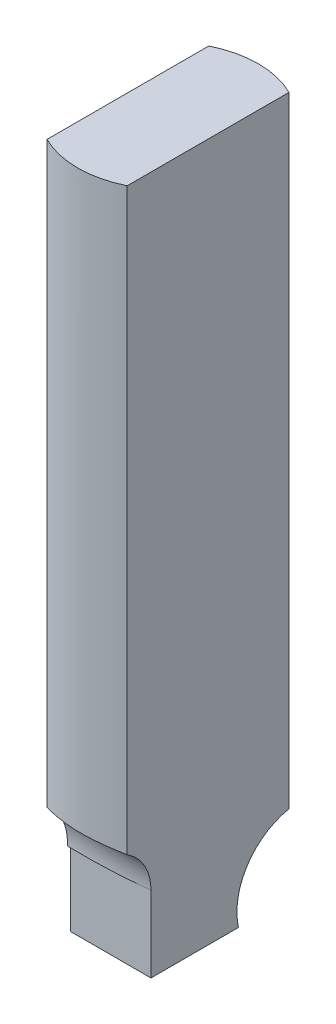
ISO-10303-21;
HEADER;
FILE_DESCRIPTION(('STEP AP214'),'2;1');
FILE_NAME('part.step','',(''),(''),'','','');
FILE_SCHEMA(('AUTOMOTIVE_DESIGN { 1 0 10303 214 1 1 1 1 }'));
ENDSEC;
DATA;
#1=APPLICATION_CONTEXT('core data for automotive mechanical design processes');
#2=APPLICATION_PROTOCOL_DEFINITION('international standard','automotive_design',2000,#1);
#3=PRODUCT_CONTEXT('',#1,'mechanical');
#4=PRODUCT('Part','Part','',(#3));
#5=PRODUCT_RELATED_PRODUCT_CATEGORY('part','',(#4));
#6=PRODUCT_DEFINITION_FORMATION('','',#4);
#7=PRODUCT_DEFINITION_CONTEXT('part definition',#1,'design');
#8=PRODUCT_DEFINITION('design','',#6,#7);
#9=PRODUCT_DEFINITION_SHAPE('','',#8);
#10=(LENGTH_UNIT() NAMED_UNIT(*) SI_UNIT(.MILLI.,.METRE.));
#11=(NAMED_UNIT(*) PLANE_ANGLE_UNIT() SI_UNIT($,.RADIAN.));
#12=(NAMED_UNIT(*) SI_UNIT($,.STERADIAN.) SOLID_ANGLE_UNIT());
#13=UNCERTAINTY_MEASURE_WITH_UNIT(LENGTH_MEASURE(1.E-05),#10,'distance_accuracy_value','');
#14=(GEOMETRIC_REPRESENTATION_CONTEXT(3) GLOBAL_UNCERTAINTY_ASSIGNED_CONTEXT((#13)) GLOBAL_UNIT_ASSIGNED_CONTEXT((#10,
#11,#12)) REPRESENTATION_CONTEXT('',''));
#15=CARTESIAN_POINT('',(0.,0.,0.));
#16=DIRECTION('',(0.,0.,1.));
#17=DIRECTION('',(1.,0.,0.));
#18=AXIS2_PLACEMENT_3D('',#15,#16,#17);
#19=CARTESIAN_POINT('',(-34.1148141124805,-29.3899377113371,-23.4559045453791));
#20=CARTESIAN_POINT('',(-34.9909961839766,-28.8066043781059,-42.4878897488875));
#21=CARTESIAN_POINT('',(-18.9468995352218,-28.2235797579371,-52.7626879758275));
#22=CARTESIAN_POINT('',(-2.90280288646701,-27.6405551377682,-63.0374862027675));
#23=CARTESIAN_POINT('',(14.0174867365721,-27.0575305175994,-54.2802997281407));
#24=CARTESIAN_POINT('',(30.9377763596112,-26.4745058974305,-45.5231132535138));
#25=CARTESIAN_POINT('',(31.8139802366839,-25.8911725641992,-26.4911290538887));
#26=CARTESIAN_POINT('',(32.6901841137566,-25.307839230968,-7.4591448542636));
#27=CARTESIAN_POINT('',(16.6461092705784,-24.7241971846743,2.81565236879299));
#28=CARTESIAN_POINT('',(0.602034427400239,-24.1405551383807,13.0904495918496));
#29=CARTESIAN_POINT('',(-16.3182333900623,-23.5569130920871,4.3332621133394));
#30=CARTESIAN_POINT('',(-33.2385012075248,-22.9732710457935,-4.4239253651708));
#31=CARTESIAN_POINT('',(-34.1146832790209,-22.3899377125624,-23.4559105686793));
#32=CARTESIAN_POINT('',(-34.9908653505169,-21.8066043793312,-42.4878957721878));
#33=CARTESIAN_POINT('',(-18.9467687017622,-21.2235797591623,-52.7626939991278));
#34=CARTESIAN_POINT('',(-2.90267205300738,-20.6405551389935,-63.0374922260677));
#35=CARTESIAN_POINT('',(14.0176175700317,-20.0575305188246,-54.2803057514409));
#36=CARTESIAN_POINT('',(30.9379071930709,-19.4745058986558,-45.5231192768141));
#37=CARTESIAN_POINT('',(31.8141110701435,-18.8911725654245,-26.491135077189));
#38=CARTESIAN_POINT('',(32.6903149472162,-18.3078392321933,-7.45915087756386));
#39=CARTESIAN_POINT('',(16.646240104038,-17.7241971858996,2.81564634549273));
#40=CARTESIAN_POINT('',(0.602165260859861,-17.140555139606,13.0904435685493));
#41=CARTESIAN_POINT('',(-16.3181025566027,-16.5569130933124,4.33325609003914));
#42=CARTESIAN_POINT('',(-33.2383703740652,-15.9732710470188,-4.42393138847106));
#43=CARTESIAN_POINT('',(-34.1145524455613,-15.3899377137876,-23.4559165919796));
#44=CARTESIAN_POINT('',(-34.9907345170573,-14.8066043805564,-42.4879017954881));
#45=CARTESIAN_POINT('',(-18.9466378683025,-14.2235797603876,-52.762700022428));
#46=CARTESIAN_POINT('',(-2.90254121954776,-13.6405551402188,-63.037498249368));
#47=CARTESIAN_POINT('',(14.0177484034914,-13.0575305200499,-54.2803117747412));
#48=CARTESIAN_POINT('',(30.9380380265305,-12.4745058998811,-45.5231253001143));
#49=CARTESIAN_POINT('',(31.8142419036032,-11.8911725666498,-26.4911411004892));
#50=CARTESIAN_POINT('',(32.6904457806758,-11.3078392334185,-7.45915690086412));
#51=CARTESIAN_POINT('',(16.6463709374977,-10.7241971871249,2.81564032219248));
#52=CARTESIAN_POINT('',(0.602296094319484,-10.1405551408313,13.0904375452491));
#53=CARTESIAN_POINT('',(-16.317971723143,-9.5569130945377,4.33325006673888));
#54=CARTESIAN_POINT('',(-33.2382395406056,-8.9732710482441,-4.42393741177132));
#55=CARTESIAN_POINT('',(-34.1144216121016,-8.38993771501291,-23.4559226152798));
#56=CARTESIAN_POINT('',(-34.9906036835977,-7.80660438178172,-42.4879078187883));
#57=CARTESIAN_POINT('',(-18.9465070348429,-7.22357976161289,-52.7627060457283));
#58=CARTESIAN_POINT('',(-2.90241038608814,-6.64055514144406,-63.0375042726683));
#59=CARTESIAN_POINT('',(14.017879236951,-6.0575305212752,-54.2803177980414));
#60=CARTESIAN_POINT('',(30.9381688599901,-5.47450590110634,-45.5231313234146));
#61=CARTESIAN_POINT('',(31.8143727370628,-4.89117256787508,-26.4911471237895));
#62=CARTESIAN_POINT('',(32.6905766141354,-4.30783923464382,-7.45916292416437));
#63=CARTESIAN_POINT('',(16.6465017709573,-3.72419718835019,2.81563429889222));
#64=CARTESIAN_POINT('',(0.602426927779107,-3.14055514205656,13.0904315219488));
#65=CARTESIAN_POINT('',(-16.3178408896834,-2.55691309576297,4.33324404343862));
#66=CARTESIAN_POINT('',(-33.2381087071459,-1.97327104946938,-4.42394343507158));
#67=CARTESIAN_POINT('',(-34.114290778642,-1.38993771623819,-23.4559286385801));
#68=CARTESIAN_POINT('',(-34.9904728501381,-0.806604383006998,-42.4879138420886));
#69=CARTESIAN_POINT('',(-18.9463762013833,-0.223579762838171,-52.7627120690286));
#70=CARTESIAN_POINT('',(-2.90227955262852,0.359444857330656,-63.0375102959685));
#71=CARTESIAN_POINT('',(14.0180100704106,0.942469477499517,-54.2803238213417));
#72=CARTESIAN_POINT('',(30.9382996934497,1.52549409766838,-45.5231373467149));
#73=CARTESIAN_POINT('',(31.8145035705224,2.10882743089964,-26.4911531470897));
#74=CARTESIAN_POINT('',(32.6907074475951,2.6921607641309,-7.45916894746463));
#75=CARTESIAN_POINT('',(16.6466326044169,3.27580281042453,2.81562827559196));
#76=CARTESIAN_POINT('',(0.60255776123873,3.85944485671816,13.0904254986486));
#77=CARTESIAN_POINT('',(-16.3177100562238,4.44308690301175,4.33323802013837));
#78=CARTESIAN_POINT('',(-33.2379778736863,5.02672894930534,-4.42394945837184));
#79=CARTESIAN_POINT('',(-34.1141599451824,5.61006228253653,-23.4559346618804));
#80=CARTESIAN_POINT('',(-34.9903420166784,6.19339561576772,-42.4879198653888));
#81=CARTESIAN_POINT('',(-18.9462453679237,6.77642023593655,-52.7627180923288));
#82=CARTESIAN_POINT('',(-2.90214871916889,7.35944485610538,-63.0375163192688));
#83=CARTESIAN_POINT('',(14.0181409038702,7.94246947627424,-54.280329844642));
#84=CARTESIAN_POINT('',(30.9384305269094,8.5254940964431,-45.5231433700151));
#85=CARTESIAN_POINT('',(31.814634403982,9.10882742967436,-26.49115917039));
#86=CARTESIAN_POINT('',(32.6908382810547,9.69216076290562,-7.45917497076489));
#87=CARTESIAN_POINT('',(16.6467634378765,10.2758028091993,2.8156222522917));
#88=CARTESIAN_POINT('',(0.602688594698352,10.8594448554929,13.0904194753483));
#89=CARTESIAN_POINT('',(-16.3175792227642,11.4430869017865,4.33323199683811));
#90=CARTESIAN_POINT('',(-33.2378470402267,12.0267289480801,-4.42395548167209));
#91=CARTESIAN_POINT('',(-34.1140291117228,12.6100622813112,-23.4559406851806));
#92=CARTESIAN_POINT('',(-34.1147206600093,-24.3899377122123,-23.4559088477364));
#93=CARTESIAN_POINT('',(-34.9909027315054,-23.8066043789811,-42.4878940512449));
#94=CARTESIAN_POINT('',(-18.9468060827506,-23.2235797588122,-52.7626922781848));
#95=CARTESIAN_POINT('',(-2.90270943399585,-22.6405551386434,-63.0374905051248));
#96=CARTESIAN_POINT('',(14.0175801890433,-22.0575305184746,-54.280304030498));
#97=CARTESIAN_POINT('',(30.9378698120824,-21.4745058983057,-45.5231175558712));
#98=CARTESIAN_POINT('',(31.8140736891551,-20.8911725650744,-26.491133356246));
#99=CARTESIAN_POINT('',(32.6902775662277,-20.3078392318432,-7.45914915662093));
#100=CARTESIAN_POINT('',(16.6462027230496,-19.7241971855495,2.81564806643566));
#101=CARTESIAN_POINT('',(0.602127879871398,-19.1405551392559,13.0904452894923));
#102=CARTESIAN_POINT('',(-16.3181399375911,-18.5569130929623,4.33325781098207));
#103=CARTESIAN_POINT('',(-33.2384077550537,-17.9732710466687,-4.42392966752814));
#104=CARTESIAN_POINT('',(-34.1145898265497,-17.3899377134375,-23.4559148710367));
#105=CARTESIAN_POINT('',(-34.9907718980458,-16.8066043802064,-42.4879000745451));
#106=CARTESIAN_POINT('',(-18.946675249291,-16.2235797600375,-52.7626983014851));
#107=CARTESIAN_POINT('',(-2.90257860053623,-15.6405551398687,-63.0374965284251));
#108=CARTESIAN_POINT('',(14.0177110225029,-15.0575305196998,-54.2803100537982));
#109=CARTESIAN_POINT('',(30.938000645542,-14.474505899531,-45.5231235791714));
#110=CARTESIAN_POINT('',(31.8142045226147,-13.8911725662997,-26.4911393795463));
#111=CARTESIAN_POINT('',(32.6904083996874,-13.3078392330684,-7.45915517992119));
#112=CARTESIAN_POINT('',(16.6463335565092,-12.7241971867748,2.8156420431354));
#113=CARTESIAN_POINT('',(0.60225871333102,-12.1405551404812,13.090439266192));
#114=CARTESIAN_POINT('',(-16.3180091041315,-11.5569130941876,4.33325178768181));
#115=CARTESIAN_POINT('',(-33.238276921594,-10.973271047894,-4.4239356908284));
#116=CARTESIAN_POINT('',(-34.1144589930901,-10.3899377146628,-23.4559208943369));
#117=CARTESIAN_POINT('',(-34.9906410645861,-9.80660438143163,-42.4879060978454));
#118=CARTESIAN_POINT('',(-18.9465444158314,-9.2235797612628,-52.7627043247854));
#119=CARTESIAN_POINT('',(-2.9024477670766,-8.64055514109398,-63.0375025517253));
#120=CARTESIAN_POINT('',(14.0178418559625,-8.05753052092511,-54.2803160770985));
#121=CARTESIAN_POINT('',(30.9381314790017,-7.47450590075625,-45.5231296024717));
#122=CARTESIAN_POINT('',(31.8143353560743,-6.89117256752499,-26.4911454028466));
#123=CARTESIAN_POINT('',(32.690539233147,-6.30783923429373,-7.45916120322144));
#124=CARTESIAN_POINT('',(16.6464643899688,-5.7241971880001,2.81563601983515));
#125=CARTESIAN_POINT('',(0.602389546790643,-5.14055514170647,13.0904332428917));
#126=CARTESIAN_POINT('',(-16.3178782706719,-4.55691309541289,4.33324576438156));
#127=CARTESIAN_POINT('',(-33.2381460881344,-3.97327104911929,-4.42394171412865));
#128=CARTESIAN_POINT('',(-34.1143281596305,-3.3899377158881,-23.4559269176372));
#129=CARTESIAN_POINT('',(-34.9905102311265,-2.80660438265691,-42.4879121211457));
#130=CARTESIAN_POINT('',(-18.9464135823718,-2.22357976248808,-52.7627103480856));
#131=CARTESIAN_POINT('',(-2.90231693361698,-1.64055514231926,-63.0375085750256));
#132=CARTESIAN_POINT('',(14.0179726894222,-1.05753052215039,-54.2803221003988));
#133=CARTESIAN_POINT('',(30.9382623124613,-0.474505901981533,-45.5231356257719));
#134=CARTESIAN_POINT('',(31.8144661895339,0.108827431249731,-26.4911514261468));
#135=CARTESIAN_POINT('',(32.6906700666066,0.692160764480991,-7.4591672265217));
#136=CARTESIAN_POINT('',(16.6465952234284,1.27580281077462,2.81562999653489));
#137=CARTESIAN_POINT('',(0.602520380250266,1.85944485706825,13.0904272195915));
#138=CARTESIAN_POINT('',(-16.3177474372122,2.44308690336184,4.3332397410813));
#139=CARTESIAN_POINT('',(-33.2380152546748,3.02672894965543,-4.42394773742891));
#140=CARTESIAN_POINT('',(-34.1141973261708,3.61006228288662,-23.4559329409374));
#141=CARTESIAN_POINT('',(-34.9903793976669,4.19339561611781,-42.4879181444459));
#142=CARTESIAN_POINT('',(-18.9462827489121,4.77642023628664,-52.7627163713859));
#143=CARTESIAN_POINT('',(-2.90218610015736,5.35944485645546,-63.0375145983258));
#144=CARTESIAN_POINT('',(14.0181035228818,5.94246947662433,-54.280328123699));
#145=CARTESIAN_POINT('',(30.9383931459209,6.52549409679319,-45.5231416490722));
#146=CARTESIAN_POINT('',(31.8145970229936,7.10882743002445,-26.4911574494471));
#147=CARTESIAN_POINT('',(32.6908009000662,7.69216076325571,-7.45917324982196));
#148=CARTESIAN_POINT('',(16.6467260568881,8.27580280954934,2.81562397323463));
#149=CARTESIAN_POINT('',(0.602651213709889,8.85944485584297,13.0904211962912));
#150=CARTESIAN_POINT('',(-16.3176166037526,9.44308690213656,4.33323371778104));
#151=CARTESIAN_POINT('',(-33.2378844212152,10.0267289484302,-4.42395376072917));
#152=CARTESIAN_POINT('',(-34.1140664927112,10.6100622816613,-23.4559389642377));
#153=CARTESIAN_POINT('',(-34.9902485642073,11.1933956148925,-42.4879241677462));
#154=CARTESIAN_POINT('',(-18.9461519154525,11.7764202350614,-52.7627223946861));
#155=CARTESIAN_POINT('',(-2.90205526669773,12.3594448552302,-63.0375206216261));
#156=CARTESIAN_POINT('',(14.0182343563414,12.942469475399,-54.2803341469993));
#157=CARTESIAN_POINT('',(30.9385239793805,13.5254940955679,-45.5231476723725));
#158=CARTESIAN_POINT('',(31.8147278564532,14.1088274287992,-26.4911634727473));
#159=CARTESIAN_POINT('',(32.6909317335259,14.6921607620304,-7.45917927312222));
#160=CARTESIAN_POINT('',(16.6468568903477,15.2758028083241,2.81561794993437));
#161=CARTESIAN_POINT('',(0.602782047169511,15.8594448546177,13.090415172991));
#162=CARTESIAN_POINT('',(-16.317485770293,16.4430869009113,4.33322769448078));
#163=CARTESIAN_POINT('',(-33.2377535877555,17.0267289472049,-4.42395978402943));
#164=CARTESIAN_POINT('',(-34.1139356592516,17.6100622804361,-23.4559449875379));
#165=CARTESIAN_POINT('',(-29.1200109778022,-24.3900312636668,-23.6858548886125));
#166=CARTESIAN_POINT('',(-29.8634336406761,-23.8066979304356,-39.8341431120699));
#167=CARTESIAN_POINT('',(-16.2503121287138,-23.2236265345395,-48.5521198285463));
#168=CARTESIAN_POINT('',(-2.63719061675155,-22.6405551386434,-57.2700965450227));
#169=CARTESIAN_POINT('',(11.7193644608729,-22.0574837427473,-49.8397855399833));
#170=CARTESIAN_POINT('',(26.0759195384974,-21.4744123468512,-42.409474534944));
#171=CARTESIAN_POINT('',(26.819364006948,-20.8910790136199,-26.2611873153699));
#172=CARTESIAN_POINT('',(27.5628084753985,-20.3077456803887,-10.1129000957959));
#173=CARTESIAN_POINT('',(13.9497087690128,-19.7241504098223,-1.39492438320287));
#174=CARTESIAN_POINT('',(0.336609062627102,-19.1405551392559,7.32305132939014));
#175=CARTESIAN_POINT('',(-14.0199242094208,-18.5569598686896,-0.107260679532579));
#176=CARTESIAN_POINT('',(-28.3764574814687,-17.9733645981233,-7.53757268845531));
#177=CARTESIAN_POINT('',(-29.1198801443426,-17.3900312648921,-23.6858609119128));
#178=CARTESIAN_POINT('',(-29.8633028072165,-16.8066979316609,-39.8341491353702));
#179=CARTESIAN_POINT('',(-16.2501812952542,-16.2236265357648,-48.5521258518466));
#180=CARTESIAN_POINT('',(-2.63705978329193,-15.6405551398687,-57.2701025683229));
#181=CARTESIAN_POINT('',(11.7194952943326,-15.0574837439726,-49.8397915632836));
#182=CARTESIAN_POINT('',(26.0760503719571,-14.4744123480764,-42.4094805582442));
#183=CARTESIAN_POINT('',(26.8194948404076,-13.8910790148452,-26.2611933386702));
#184=CARTESIAN_POINT('',(27.5629393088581,-13.3077456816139,-10.1129061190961));
#185=CARTESIAN_POINT('',(13.9498396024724,-12.7241504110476,-1.39493040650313));
#186=CARTESIAN_POINT('',(0.336739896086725,-12.1405551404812,7.32304530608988));
#187=CARTESIAN_POINT('',(-14.0197933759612,-11.5569598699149,-0.107266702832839));
#188=CARTESIAN_POINT('',(-28.3763266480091,-10.9733645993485,-7.53757871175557));
#189=CARTESIAN_POINT('',(-29.119749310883,-10.3900312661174,-23.685866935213));
#190=CARTESIAN_POINT('',(-29.8631719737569,-9.80669793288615,-39.8341551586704));
#191=CARTESIAN_POINT('',(-16.2500504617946,-9.22362653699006,-48.5521318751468));
#192=CARTESIAN_POINT('',(-2.63692894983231,-8.64055514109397,-57.2701085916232));
#193=CARTESIAN_POINT('',(11.7196261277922,-8.05748374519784,-49.8397975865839));
#194=CARTESIAN_POINT('',(26.0761812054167,-7.47441234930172,-42.4094865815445));
#195=CARTESIAN_POINT('',(26.8196256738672,-6.89107901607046,-26.2611993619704));
#196=CARTESIAN_POINT('',(27.5630701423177,-6.30774568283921,-10.1129121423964));
#197=CARTESIAN_POINT('',(13.949970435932,-5.72415041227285,-1.39493642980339));
#198=CARTESIAN_POINT('',(0.336870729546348,-5.14055514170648,7.32303928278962));
#199=CARTESIAN_POINT('',(-14.0196625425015,-4.55695987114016,-0.107272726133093));
#200=CARTESIAN_POINT('',(-28.3761958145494,-3.97336460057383,-7.53758473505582));
#201=CARTESIAN_POINT('',(-29.1196184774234,-3.39003126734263,-23.6858729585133));
#202=CARTESIAN_POINT('',(-29.8630411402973,-2.80669793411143,-39.8341611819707));
#203=CARTESIAN_POINT('',(-16.249919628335,-2.22362653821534,-48.5521378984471));
#204=CARTESIAN_POINT('',(-2.63679811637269,-1.64055514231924,-57.2701146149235));
#205=CARTESIAN_POINT('',(11.7197569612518,-1.05748374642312,-49.8398036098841));
#206=CARTESIAN_POINT('',(26.0763120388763,-0.474412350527,-42.4094926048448));
#207=CARTESIAN_POINT('',(26.8197565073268,0.108920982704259,-26.2612053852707));
#208=CARTESIAN_POINT('',(27.5632009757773,0.692254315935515,-10.1129181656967));
#209=CARTESIAN_POINT('',(13.9501012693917,1.27584958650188,-1.39494245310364));
#210=CARTESIAN_POINT('',(0.337001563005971,1.85944485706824,7.32303325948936));
#211=CARTESIAN_POINT('',(-14.0195317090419,2.44304012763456,-0.107278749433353));
#212=CARTESIAN_POINT('',(-28.3760649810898,3.02663539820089,-7.53759075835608));
#213=CARTESIAN_POINT('',(-29.1194876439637,3.60996873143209,-23.6858789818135));
#214=CARTESIAN_POINT('',(-29.8629103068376,4.19330206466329,-39.834167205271));
#215=CARTESIAN_POINT('',(-16.2497887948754,4.77637346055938,-48.5521439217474));
#216=CARTESIAN_POINT('',(-2.63666728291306,5.35944485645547,-57.2701206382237));
#217=CARTESIAN_POINT('',(11.7198877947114,5.9425162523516,-49.8398096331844));
#218=CARTESIAN_POINT('',(26.0764428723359,6.52558764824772,-42.409498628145));
#219=CARTESIAN_POINT('',(26.8198873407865,7.10892098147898,-26.261211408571));
#220=CARTESIAN_POINT('',(27.563331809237,7.69225431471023,-10.1129241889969));
#221=CARTESIAN_POINT('',(13.9502321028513,8.2758495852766,-1.3949484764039));
#222=CARTESIAN_POINT('',(0.337132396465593,8.85944485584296,7.32302723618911));
#223=CARTESIAN_POINT('',(-14.0194008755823,9.44304012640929,-0.107284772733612));
#224=CARTESIAN_POINT('',(-28.3759341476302,10.0266353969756,-7.53759678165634));
#225=CARTESIAN_POINT('',(-29.1193568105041,10.6099687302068,-23.6858850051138));
#226=CARTESIAN_POINT('',(-29.862779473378,11.193302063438,-39.8341732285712));
#227=CARTESIAN_POINT('',(-16.2496579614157,11.7763734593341,-48.5521499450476));
#228=CARTESIAN_POINT('',(-2.63653644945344,12.3594448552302,-57.270126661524));
#229=CARTESIAN_POINT('',(11.7200186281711,12.9425162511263,-49.8398156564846));
#230=CARTESIAN_POINT('',(26.0765737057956,13.5255876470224,-42.4095046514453));
#231=CARTESIAN_POINT('',(26.8200181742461,14.1089209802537,-26.2612174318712));
#232=CARTESIAN_POINT('',(27.5634626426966,14.692254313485,-10.1129302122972));
#233=CARTESIAN_POINT('',(13.9503629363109,15.2758495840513,-1.39495449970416));
#234=CARTESIAN_POINT('',(0.337263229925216,15.8594448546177,7.32302121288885));
#235=CARTESIAN_POINT('',(-14.0192700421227,16.443040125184,-0.107290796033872));
#236=CARTESIAN_POINT('',(-28.3758033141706,17.0266353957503,-7.5376028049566));
#237=CARTESIAN_POINT('',(-29.1192259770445,17.6099687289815,-23.685891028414));
#238=CARTESIAN_POINT('',(-29.1201044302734,-29.3900312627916,-23.6858505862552));
#239=CARTESIAN_POINT('',(-29.8635270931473,-28.8066979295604,-39.8341388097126));
#240=CARTESIAN_POINT('',(-16.250405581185,-28.2236265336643,-48.552115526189));
#241=CARTESIAN_POINT('',(-2.63728406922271,-27.6405551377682,-57.2700922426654));
#242=CARTESIAN_POINT('',(11.7192710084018,-27.0574837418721,-49.839781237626));
#243=CARTESIAN_POINT('',(26.0758260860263,-26.474412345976,-42.4094702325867));
#244=CARTESIAN_POINT('',(26.8192705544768,-25.8910790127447,-26.2611830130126));
#245=CARTESIAN_POINT('',(27.5627150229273,-25.3077456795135,-10.1128957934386));
#246=CARTESIAN_POINT('',(13.9496153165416,-24.7241504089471,-1.39492008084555));
#247=CARTESIAN_POINT('',(0.336515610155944,-24.1405551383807,7.32305563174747));
#248=CARTESIAN_POINT('',(-14.0200176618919,-23.5569598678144,-0.107256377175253));
#249=CARTESIAN_POINT('',(-28.3765509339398,-22.9733645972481,-7.53756838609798));
#250=CARTESIAN_POINT('',(-29.1199735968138,-22.3900312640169,-23.6858566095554));
#251=CARTESIAN_POINT('',(-29.8633962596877,-21.8066979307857,-39.8341448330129));
#252=CARTESIAN_POINT('',(-16.2502747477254,-21.2236265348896,-48.5521215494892));
#253=CARTESIAN_POINT('',(-2.63715323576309,-20.6405551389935,-57.2700982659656));
#254=CARTESIAN_POINT('',(11.7194018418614,-20.0574837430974,-49.8397872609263));
#255=CARTESIAN_POINT('',(26.0759569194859,-19.4744123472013,-42.4094762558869));
#256=CARTESIAN_POINT('',(26.8194013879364,-18.89107901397,-26.2611890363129));
#257=CARTESIAN_POINT('',(27.5628458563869,-18.3077456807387,-10.1129018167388));
#258=CARTESIAN_POINT('',(13.9497461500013,-17.7241504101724,-1.3949261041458));
#259=CARTESIAN_POINT('',(0.336646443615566,-17.140555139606,7.32304960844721));
#260=CARTESIAN_POINT('',(-14.0198868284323,-16.5569598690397,-0.107262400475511));
#261=CARTESIAN_POINT('',(-28.3764201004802,-15.9733645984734,-7.53757440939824));
#262=CARTESIAN_POINT('',(-29.1198427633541,-15.3900312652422,-23.6858626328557));
#263=CARTESIAN_POINT('',(-29.863265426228,-14.806697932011,-39.8341508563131));
#264=CARTESIAN_POINT('',(-16.2501439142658,-14.2236265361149,-48.5521275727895));
#265=CARTESIAN_POINT('',(-2.63702240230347,-13.6405551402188,-57.2701042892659));
#266=CARTESIAN_POINT('',(11.719532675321,-13.0574837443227,-49.8397932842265));
#267=CARTESIAN_POINT('',(26.0760877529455,-12.4744123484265,-42.4094822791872));
#268=CARTESIAN_POINT('',(26.819532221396,-11.8910790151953,-26.2611950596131));
#269=CARTESIAN_POINT('',(27.5629766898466,-11.307745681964,-10.1129078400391));
#270=CARTESIAN_POINT('',(13.9498769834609,-10.7241504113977,-1.39493212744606));
#271=CARTESIAN_POINT('',(0.336777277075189,-10.1405551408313,7.32304358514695));
#272=CARTESIAN_POINT('',(-14.0197559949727,-9.55695987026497,-0.107268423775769));
#273=CARTESIAN_POINT('',(-28.3762892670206,-8.97336459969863,-7.5375804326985));
#274=CARTESIAN_POINT('',(-29.1197119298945,-8.39003126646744,-23.6858686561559));
#275=CARTESIAN_POINT('',(-29.8631345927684,-7.80669793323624,-39.8341568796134));
#276=CARTESIAN_POINT('',(-16.2500130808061,-7.22362653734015,-48.5521335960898));
#277=CARTESIAN_POINT('',(-2.63689156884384,-6.64055514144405,-57.2701103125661));
#278=CARTESIAN_POINT('',(11.7196635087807,-6.05748374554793,-49.8397993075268));
#279=CARTESIAN_POINT('',(26.0762185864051,-5.47441234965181,-42.4094883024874));
#280=CARTESIAN_POINT('',(26.8196630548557,-4.89107901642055,-26.2612010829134));
#281=CARTESIAN_POINT('',(27.5631075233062,-4.3077456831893,-10.1129138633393));
#282=CARTESIAN_POINT('',(13.9500078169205,-3.72415041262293,-1.39493815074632));
#283=CARTESIAN_POINT('',(0.336908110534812,-3.14055514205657,7.32303756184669));
#284=CARTESIAN_POINT('',(-14.0196251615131,-2.55695987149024,-0.107274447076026));
#285=CARTESIAN_POINT('',(-28.376158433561,-1.97336460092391,-7.53758645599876));
#286=CARTESIAN_POINT('',(-29.1195810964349,-1.39003126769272,-23.6858746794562));
#287=CARTESIAN_POINT('',(-29.8630037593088,-0.80669793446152,-39.8341629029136));
#288=CARTESIAN_POINT('',(-16.2498822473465,-0.223626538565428,-48.55213961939));
#289=CARTESIAN_POINT('',(-2.63676073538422,0.359444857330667,-57.2701163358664));
#290=CARTESIAN_POINT('',(11.7197943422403,0.942516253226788,-49.839805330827));
#291=CARTESIAN_POINT('',(26.0763494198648,1.52558764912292,-42.4094943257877));
#292=CARTESIAN_POINT('',(26.8197938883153,2.10892098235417,-26.2612071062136));
#293=CARTESIAN_POINT('',(27.5632383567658,2.69225431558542,-10.1129198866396));
#294=CARTESIAN_POINT('',(13.9501386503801,3.27584958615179,-1.39494417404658));
#295=CARTESIAN_POINT('',(0.337038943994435,3.85944485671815,7.32303153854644));
#296=CARTESIAN_POINT('',(-14.0194943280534,4.44304012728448,-0.107280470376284));
#297=CARTESIAN_POINT('',(-28.3760276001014,5.02663539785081,-7.53759247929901));
#298=CARTESIAN_POINT('',(-29.1194502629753,5.60996873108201,-23.6858807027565));
#299=CARTESIAN_POINT('',(-29.8628729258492,6.1933020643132,-39.8341689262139));
#300=CARTESIAN_POINT('',(-16.2497514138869,6.7763734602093,-48.5521456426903));
#301=CARTESIAN_POINT('',(-2.6366299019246,7.35944485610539,-57.2701223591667));
#302=CARTESIAN_POINT('',(11.7199251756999,7.94251625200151,-49.8398113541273));
#303=CARTESIAN_POINT('',(26.0764802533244,8.52558764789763,-42.4095003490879));
#304=CARTESIAN_POINT('',(26.8199247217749,9.10892098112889,-26.2612131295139));
#305=CARTESIAN_POINT('',(27.5633691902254,9.69225431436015,-10.1129259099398));
#306=CARTESIAN_POINT('',(13.9502694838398,10.2758495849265,-1.39495019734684));
#307=CARTESIAN_POINT('',(0.337169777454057,10.8594448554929,7.32302551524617));
#308=CARTESIAN_POINT('',(-14.0193634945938,11.4430401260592,-0.107286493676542));
#309=CARTESIAN_POINT('',(-28.3758967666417,12.0266353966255,-7.53759850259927));
#310=CARTESIAN_POINT('',(-29.1193194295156,12.6099687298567,-23.6858867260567));
#311=CARTESIAN_POINT('',(-29.1201978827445,-34.3900312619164,-23.6858462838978));
#312=CARTESIAN_POINT('',(-29.8636205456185,-33.8066979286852,-39.8341345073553));
#313=CARTESIAN_POINT('',(-16.2504990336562,-33.2236265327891,-48.5521112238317));
#314=CARTESIAN_POINT('',(-2.63737752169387,-32.640555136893,-57.270087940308));
#315=CARTESIAN_POINT('',(11.7191775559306,-32.0574837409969,-49.8397769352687));
#316=CARTESIAN_POINT('',(26.0757326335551,-31.4744123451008,-42.4094659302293));
#317=CARTESIAN_POINT('',(26.8191771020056,-30.8910790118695,-26.2611787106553));
#318=CARTESIAN_POINT('',(27.5626215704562,-30.3077456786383,-10.1128914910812));
#319=CARTESIAN_POINT('',(13.9495218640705,-29.7241504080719,-1.39491577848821));
#320=CARTESIAN_POINT('',(0.336422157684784,-29.1405551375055,7.32305993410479));
#321=CARTESIAN_POINT('',(-14.0201111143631,-28.5569598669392,-0.107252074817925));
#322=CARTESIAN_POINT('',(-28.376644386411,-27.9733645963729,-7.53756408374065));
#323=CARTESIAN_POINT('',(-29.1200670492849,-27.3900312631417,-23.6858523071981));
#324=CARTESIAN_POINT('',(-29.8634897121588,-26.8066979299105,-39.8341405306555));
#325=CARTESIAN_POINT('',(-16.2503682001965,-26.2236265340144,-48.5521172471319));
#326=CARTESIAN_POINT('',(-2.63724668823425,-25.6405551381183,-57.2700939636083));
#327=CARTESIAN_POINT('',(11.7193083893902,-25.0574837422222,-49.8397829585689));
#328=CARTESIAN_POINT('',(26.0758634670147,-24.4744123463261,-42.4094719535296));
#329=CARTESIAN_POINT('',(26.8193079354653,-23.8910790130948,-26.2611847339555));
#330=CARTESIAN_POINT('',(27.5627524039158,-23.3077456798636,-10.1128975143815));
#331=CARTESIAN_POINT('',(13.9496526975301,-22.7241504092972,-1.39492180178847));
#332=CARTESIAN_POINT('',(0.336552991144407,-22.1405551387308,7.32305391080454));
#333=CARTESIAN_POINT('',(-14.0199802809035,-21.5569598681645,-0.107258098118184));
#334=CARTESIAN_POINT('',(-28.3765135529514,-20.9733645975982,-7.53757010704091));
#335=CARTESIAN_POINT('',(-29.1199362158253,-20.390031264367,-23.6858583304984));
#336=CARTESIAN_POINT('',(-29.8633588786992,-19.8066979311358,-39.8341465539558));
#337=CARTESIAN_POINT('',(-16.2502373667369,-19.2236265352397,-48.5521232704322));
#338=CARTESIAN_POINT('',(-2.63711585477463,-18.6405551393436,-57.2700999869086));
#339=CARTESIAN_POINT('',(11.7194392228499,-18.0574837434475,-49.8397889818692));
#340=CARTESIAN_POINT('',(26.0759943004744,-17.4744123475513,-42.4094779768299));
#341=CARTESIAN_POINT('',(26.8194387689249,-16.8910790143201,-26.2611907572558));
#342=CARTESIAN_POINT('',(27.5628832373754,-16.3077456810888,-10.1129035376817));
#343=CARTESIAN_POINT('',(13.9497835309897,-15.7241504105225,-1.39492782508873));
#344=CARTESIAN_POINT('',(0.33668382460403,-15.1405551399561,7.32304788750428));
#345=CARTESIAN_POINT('',(-14.0198494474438,-14.5569598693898,-0.107264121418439));
#346=CARTESIAN_POINT('',(-28.3763827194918,-13.9733645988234,-7.53757613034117));
#347=CARTESIAN_POINT('',(-29.1198053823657,-13.3900312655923,-23.6858643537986));
#348=CARTESIAN_POINT('',(-29.8632280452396,-12.8066979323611,-39.834152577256));
#349=CARTESIAN_POINT('',(-16.2501065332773,-12.223626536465,-48.5521292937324));
#350=CARTESIAN_POINT('',(-2.636985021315,-11.6405551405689,-57.2701060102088));
#351=CARTESIAN_POINT('',(11.7195700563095,-11.0574837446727,-49.8397950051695));
#352=CARTESIAN_POINT('',(26.076125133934,-10.4744123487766,-42.4094840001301));
#353=CARTESIAN_POINT('',(26.8195696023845,-9.89107901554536,-26.2611967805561));
#354=CARTESIAN_POINT('',(27.563014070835,-9.3077456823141,-10.112909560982));
#355=CARTESIAN_POINT('',(13.9499143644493,-8.72415041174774,-1.39493384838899));
#356=CARTESIAN_POINT('',(0.336814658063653,-8.14055514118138,7.32304186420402));
#357=CARTESIAN_POINT('',(-14.0197186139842,-7.55695987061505,-0.107270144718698));
#358=CARTESIAN_POINT('',(-28.3762518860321,-6.97336460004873,-7.53758215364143));
#359=CARTESIAN_POINT('',(-29.1196745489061,-6.39003126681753,-23.6858703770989));
#360=CARTESIAN_POINT('',(-29.86309721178,-5.80669793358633,-39.8341586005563));
#361=CARTESIAN_POINT('',(-16.2499756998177,-5.22362653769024,-48.5521353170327));
#362=CARTESIAN_POINT('',(-2.63685418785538,-4.64055514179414,-57.2701120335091));
#363=CARTESIAN_POINT('',(11.7197008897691,-4.05748374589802,-49.8398010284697));
#364=CARTESIAN_POINT('',(26.0762559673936,-3.47441235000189,-42.4094900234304));
#365=CARTESIAN_POINT('',(26.8197004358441,-2.89107901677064,-26.2612028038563));
#366=CARTESIAN_POINT('',(27.5631449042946,-2.30774568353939,-10.1129155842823));
#367=CARTESIAN_POINT('',(13.950045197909,-1.72415041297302,-1.39493987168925));
#368=CARTESIAN_POINT('',(0.336945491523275,-1.14055514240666,7.32303584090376));
#369=CARTESIAN_POINT('',(-14.0195877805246,-0.556959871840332,-0.107276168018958));
#370=CARTESIAN_POINT('',(-28.3761210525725,0.026635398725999,-7.53758817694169));
#371=CARTESIAN_POINT('',(-29.1195437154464,0.609968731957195,-23.6858764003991));
#372=CARTESIAN_POINT('',(-29.8629663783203,1.19330206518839,-39.8341646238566));
#373=CARTESIAN_POINT('',(-16.249844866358,1.77637346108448,-48.5521413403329));
#374=CARTESIAN_POINT('',(-2.63672335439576,2.35944485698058,-57.2701180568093));
#375=CARTESIAN_POINT('',(11.7198317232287,2.9425162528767,-49.83980705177));
#376=CARTESIAN_POINT('',(26.0763868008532,3.52558764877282,-42.4094960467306));
#377=CARTESIAN_POINT('',(26.8198312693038,4.10892098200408,-26.2612088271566));
#378=CARTESIAN_POINT('',(27.5632757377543,4.69225431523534,-10.1129216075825));
#379=CARTESIAN_POINT('',(13.9501760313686,5.2758495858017,-1.39494589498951));
#380=CARTESIAN_POINT('',(0.337076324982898,5.85944485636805,7.3230298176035));
#381=CARTESIAN_POINT('',(-14.019456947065,6.44304012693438,-0.107282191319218));
#382=CARTESIAN_POINT('',(-28.3759902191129,7.02663539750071,-7.53759420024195));
#383=CARTESIAN_POINT('',(-29.1194128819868,7.60996873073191,-23.6858824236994));
#384=CARTESIAN_POINT('',(-34.1149075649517,-34.3899377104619,-23.4559002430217));
#385=CARTESIAN_POINT('',(-34.9910896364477,-33.8066043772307,-42.4878854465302));
#386=CARTESIAN_POINT('',(-18.9469929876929,-33.2235797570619,-52.7626836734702));
#387=CARTESIAN_POINT('',(-2.90289633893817,-32.640555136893,-63.0374819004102));
#388=CARTESIAN_POINT('',(14.017393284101,-32.0575305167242,-54.2802954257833));
#389=CARTESIAN_POINT('',(30.9376829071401,-31.4745058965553,-45.5231089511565));
#390=CARTESIAN_POINT('',(31.8138867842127,-30.8911725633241,-26.4911247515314));
#391=CARTESIAN_POINT('',(32.6900906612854,-30.3078392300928,-7.45914055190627));
#392=CARTESIAN_POINT('',(16.6460158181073,-29.7241971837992,2.81565667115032));
#393=CARTESIAN_POINT('',(0.601940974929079,-29.1405551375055,13.0904538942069));
#394=CARTESIAN_POINT('',(-16.3183268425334,-28.5569130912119,4.33326641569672));
#395=CARTESIAN_POINT('',(-33.238594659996,-27.9732710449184,-4.42392106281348));
#396=CARTESIAN_POINT('',(-34.114776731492,-27.3899377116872,-23.455906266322));
#397=CARTESIAN_POINT('',(-34.9909588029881,-26.806604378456,-42.4878914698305));
#398=CARTESIAN_POINT('',(-18.9468621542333,-26.2235797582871,-52.7626896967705));
#399=CARTESIAN_POINT('',(-2.90276550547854,-25.6405551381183,-63.0374879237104));
#400=CARTESIAN_POINT('',(14.0175241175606,-25.0575305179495,-54.2803014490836));
#401=CARTESIAN_POINT('',(30.9378137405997,-24.4745058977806,-45.5231149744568));
#402=CARTESIAN_POINT('',(31.8140176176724,-23.8911725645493,-26.4911307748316));
#403=CARTESIAN_POINT('',(32.690221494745,-23.3078392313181,-7.45914657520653));
#404=CARTESIAN_POINT('',(16.6461466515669,-22.7241971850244,2.81565064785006));
#405=CARTESIAN_POINT('',(0.602071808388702,-22.1405551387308,13.0904478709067));
#406=CARTESIAN_POINT('',(-16.3181960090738,-21.5569130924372,4.33326039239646));
#407=CARTESIAN_POINT('',(-33.2384638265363,-20.9732710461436,-4.42392708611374));
#408=CARTESIAN_POINT('',(-34.1146458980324,-20.3899377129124,-23.4559122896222));
#409=CARTESIAN_POINT('',(-34.9908279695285,-19.8066043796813,-42.4878974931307));
#410=CARTESIAN_POINT('',(-18.9467313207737,-19.2235797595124,-52.7626957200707));
#411=CARTESIAN_POINT('',(-2.90263467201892,-18.6405551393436,-63.0374939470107));
#412=CARTESIAN_POINT('',(14.0176549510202,-18.0575305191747,-54.2803074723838));
#413=CARTESIAN_POINT('',(30.9379445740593,-17.4745058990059,-45.523120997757));
#414=CARTESIAN_POINT('',(31.814148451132,-16.8911725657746,-26.4911367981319));
#415=CARTESIAN_POINT('',(32.6903523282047,-16.3078392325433,-7.45915259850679));
#416=CARTESIAN_POINT('',(16.6462774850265,-15.7241971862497,2.8156446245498));
#417=CARTESIAN_POINT('',(0.602202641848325,-15.1405551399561,13.0904418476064));
#418=CARTESIAN_POINT('',(-16.3180651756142,-14.5569130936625,4.33325436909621));
#419=CARTESIAN_POINT('',(-33.2383329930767,-13.9732710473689,-4.423933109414));
#420=CARTESIAN_POINT('',(-34.1145150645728,-13.3899377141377,-23.4559183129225));
#421=CARTESIAN_POINT('',(-34.9906971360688,-12.8066043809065,-42.487903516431));
#422=CARTESIAN_POINT('',(-18.9466004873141,-12.2235797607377,-52.762701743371));
#423=CARTESIAN_POINT('',(-2.9025038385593,-11.6405551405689,-63.0374999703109));
#424=CARTESIAN_POINT('',(14.0177857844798,-11.0575305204,-54.2803134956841));
#425=CARTESIAN_POINT('',(30.938075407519,-10.4745059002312,-45.5231270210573));
#426=CARTESIAN_POINT('',(31.8142792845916,-9.89117256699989,-26.4911428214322));
#427=CARTESIAN_POINT('',(32.6904831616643,-9.30783923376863,-7.45915862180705));
#428=CARTESIAN_POINT('',(16.6464083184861,-8.724197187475,2.81563860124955));
#429=CARTESIAN_POINT('',(0.602333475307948,-8.14055514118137,13.0904358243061));
#430=CARTESIAN_POINT('',(-16.3179343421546,-7.55691309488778,4.33324834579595));
#431=CARTESIAN_POINT('',(-33.2382021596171,-6.97327104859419,-4.42393913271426));
#432=CARTESIAN_POINT('',(-34.1143842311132,-6.389937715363,-23.4559243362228));
#433=CARTESIAN_POINT('',(-34.9905663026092,-5.80660438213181,-42.4879095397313));
#434=CARTESIAN_POINT('',(-18.9464696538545,-5.22357976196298,-52.7627077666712));
#435=CARTESIAN_POINT('',(-2.90237300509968,-4.64055514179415,-63.0375059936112));
#436=CARTESIAN_POINT('',(14.0179166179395,-4.05753052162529,-54.2803195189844));
#437=CARTESIAN_POINT('',(30.9382062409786,-3.47450590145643,-45.5231330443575));
#438=CARTESIAN_POINT('',(31.8144101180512,-2.89117256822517,-26.4911488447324));
#439=CARTESIAN_POINT('',(32.6906139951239,-2.30783923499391,-7.45916464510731));
#440=CARTESIAN_POINT('',(16.6465391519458,-1.72419718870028,2.81563257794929));
#441=CARTESIAN_POINT('',(0.602464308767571,-1.14055514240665,13.0904298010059));
#442=CARTESIAN_POINT('',(-16.3178035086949,-0.55691309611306,4.33324232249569));
#443=CARTESIAN_POINT('',(-33.2380713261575,0.0267289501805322,-4.42394515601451));
#444=CARTESIAN_POINT('',(-34.1142533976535,0.610062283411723,-23.455930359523));
#445=CARTESIAN_POINT('',(-34.9904354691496,1.19339561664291,-42.4879155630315));
#446=CARTESIAN_POINT('',(-18.9463388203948,1.77642023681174,-52.7627137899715));
#447=CARTESIAN_POINT('',(-2.90224217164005,2.35944485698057,-63.0375120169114));
#448=CARTESIAN_POINT('',(14.0180474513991,2.94246947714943,-54.2803255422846));
#449=CARTESIAN_POINT('',(30.9383370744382,3.52549409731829,-45.5231390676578));
#450=CARTESIAN_POINT('',(31.8145409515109,4.10882743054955,-26.4911548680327));
#451=CARTESIAN_POINT('',(32.6907448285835,4.69216076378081,-7.45917066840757));
#452=CARTESIAN_POINT('',(16.6466699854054,5.27580281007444,2.81562655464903));
#453=CARTESIAN_POINT('',(0.602595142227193,5.85944485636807,13.0904237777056));
#454=CARTESIAN_POINT('',(-16.3176726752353,6.44308690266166,4.33323629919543));
#455=CARTESIAN_POINT('',(-33.2379404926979,7.02672894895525,-4.42395117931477));
#456=CARTESIAN_POINT('',(-34.1141225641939,7.61006228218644,-23.4559363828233));
#457=CARTESIAN_POINT('',(-34.1148141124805,-29.3899377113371,-23.4559045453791));
#458=CARTESIAN_POINT('',(-34.9909961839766,-28.8066043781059,-42.4878897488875));
#459=CARTESIAN_POINT('',(-18.9468995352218,-28.2235797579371,-52.7626879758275));
#460=CARTESIAN_POINT('',(-2.90280288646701,-27.6405551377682,-63.0374862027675));
#461=CARTESIAN_POINT('',(14.0174867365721,-27.0575305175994,-54.2802997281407));
#462=CARTESIAN_POINT('',(30.9377763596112,-26.4745058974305,-45.5231132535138));
#463=CARTESIAN_POINT('',(31.8139802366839,-25.8911725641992,-26.4911290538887));
#464=CARTESIAN_POINT('',(32.6901841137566,-25.307839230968,-7.4591448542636));
#465=CARTESIAN_POINT('',(16.6461092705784,-24.7241971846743,2.81565236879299));
#466=CARTESIAN_POINT('',(0.602034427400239,-24.1405551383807,13.0904495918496));
#467=CARTESIAN_POINT('',(-16.3182333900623,-23.5569130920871,4.3332621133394));
#468=CARTESIAN_POINT('',(-33.2385012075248,-22.9732710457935,-4.4239253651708));
#469=CARTESIAN_POINT('',(-34.1146832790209,-22.3899377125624,-23.4559105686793));
#470=CARTESIAN_POINT('',(-34.9908653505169,-21.8066043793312,-42.4878957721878));
#471=CARTESIAN_POINT('',(-18.9467687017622,-21.2235797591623,-52.7626939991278));
#472=CARTESIAN_POINT('',(-2.90267205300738,-20.6405551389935,-63.0374922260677));
#473=CARTESIAN_POINT('',(14.0176175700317,-20.0575305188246,-54.2803057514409));
#474=CARTESIAN_POINT('',(30.9379071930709,-19.4745058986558,-45.5231192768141));
#475=CARTESIAN_POINT('',(31.8141110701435,-18.8911725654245,-26.491135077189));
#476=CARTESIAN_POINT('',(32.6903149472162,-18.3078392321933,-7.45915087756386));
#477=CARTESIAN_POINT('',(16.646240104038,-17.7241971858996,2.81564634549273));
#478=CARTESIAN_POINT('',(0.602165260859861,-17.140555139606,13.0904435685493));
#479=CARTESIAN_POINT('',(-16.3181025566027,-16.5569130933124,4.33325609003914));
#480=CARTESIAN_POINT('',(-33.2383703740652,-15.9732710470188,-4.42393138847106));
#481=CARTESIAN_POINT('',(-34.1145524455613,-15.3899377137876,-23.4559165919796));
#482=CARTESIAN_POINT('',(-34.9907345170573,-14.8066043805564,-42.4879017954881));
#483=CARTESIAN_POINT('',(-18.9466378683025,-14.2235797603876,-52.762700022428));
#484=CARTESIAN_POINT('',(-2.90254121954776,-13.6405551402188,-63.037498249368));
#485=CARTESIAN_POINT('',(14.0177484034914,-13.0575305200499,-54.2803117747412));
#486=CARTESIAN_POINT('',(30.9380380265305,-12.4745058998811,-45.5231253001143));
#487=CARTESIAN_POINT('',(31.8142419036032,-11.8911725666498,-26.4911411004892));
#488=CARTESIAN_POINT('',(32.6904457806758,-11.3078392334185,-7.45915690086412));
#489=CARTESIAN_POINT('',(16.6463709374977,-10.7241971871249,2.81564032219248));
#490=CARTESIAN_POINT('',(0.602296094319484,-10.1405551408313,13.0904375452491));
#491=CARTESIAN_POINT('',(-16.317971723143,-9.5569130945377,4.33325006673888));
#492=CARTESIAN_POINT('',(-33.2382395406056,-8.9732710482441,-4.42393741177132));
#493=CARTESIAN_POINT('',(-34.1144216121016,-8.38993771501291,-23.4559226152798));
#494=CARTESIAN_POINT('',(-34.9906036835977,-7.80660438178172,-42.4879078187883));
#495=CARTESIAN_POINT('',(-18.9465070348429,-7.22357976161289,-52.7627060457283));
#496=CARTESIAN_POINT('',(-2.90241038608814,-6.64055514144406,-63.0375042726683));
#497=CARTESIAN_POINT('',(14.017879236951,-6.0575305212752,-54.2803177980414));
#498=CARTESIAN_POINT('',(30.9381688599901,-5.47450590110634,-45.5231313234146));
#499=CARTESIAN_POINT('',(31.8143727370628,-4.89117256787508,-26.4911471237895));
#500=CARTESIAN_POINT('',(32.6905766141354,-4.30783923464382,-7.45916292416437));
#501=CARTESIAN_POINT('',(16.6465017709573,-3.72419718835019,2.81563429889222));
#502=CARTESIAN_POINT('',(0.602426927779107,-3.14055514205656,13.0904315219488));
#503=CARTESIAN_POINT('',(-16.3178408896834,-2.55691309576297,4.33324404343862));
#504=CARTESIAN_POINT('',(-33.2381087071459,-1.97327104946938,-4.42394343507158));
#505=CARTESIAN_POINT('',(-34.114290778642,-1.38993771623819,-23.4559286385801));
#506=CARTESIAN_POINT('',(-34.9904728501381,-0.806604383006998,-42.4879138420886));
#507=CARTESIAN_POINT('',(-18.9463762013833,-0.223579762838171,-52.7627120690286));
#508=CARTESIAN_POINT('',(-2.90227955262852,0.359444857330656,-63.0375102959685));
#509=CARTESIAN_POINT('',(14.0180100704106,0.942469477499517,-54.2803238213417));
#510=CARTESIAN_POINT('',(30.9382996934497,1.52549409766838,-45.5231373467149));
#511=CARTESIAN_POINT('',(31.8145035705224,2.10882743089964,-26.4911531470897));
#512=CARTESIAN_POINT('',(32.6907074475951,2.6921607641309,-7.45916894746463));
#513=CARTESIAN_POINT('',(16.6466326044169,3.27580281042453,2.81562827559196));
#514=CARTESIAN_POINT('',(0.60255776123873,3.85944485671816,13.0904254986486));
#515=CARTESIAN_POINT('',(-16.3177100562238,4.44308690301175,4.33323802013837));
#516=CARTESIAN_POINT('',(-33.2379778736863,5.02672894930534,-4.42394945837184));
#517=CARTESIAN_POINT('',(-34.1141599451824,5.61006228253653,-23.4559346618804));
#518=CARTESIAN_POINT('',(-34.9903420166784,6.19339561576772,-42.4879198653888));
#519=CARTESIAN_POINT('',(-18.9462453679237,6.77642023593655,-52.7627180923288));
#520=CARTESIAN_POINT('',(-2.90214871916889,7.35944485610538,-63.0375163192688));
#521=CARTESIAN_POINT('',(14.0181409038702,7.94246947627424,-54.280329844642));
#522=CARTESIAN_POINT('',(30.9384305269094,8.5254940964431,-45.5231433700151));
#523=CARTESIAN_POINT('',(31.814634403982,9.10882742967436,-26.49115917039));
#524=CARTESIAN_POINT('',(32.6908382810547,9.69216076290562,-7.45917497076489));
#525=CARTESIAN_POINT('',(16.6467634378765,10.2758028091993,2.8156222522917));
#526=CARTESIAN_POINT('',(0.602688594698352,10.8594448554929,13.0904194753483));
#527=CARTESIAN_POINT('',(-16.3175792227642,11.4430869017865,4.33323199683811));
#528=CARTESIAN_POINT('',(-33.2378470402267,12.0267289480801,-4.42395548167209));
#529=CARTESIAN_POINT('',(-34.1140291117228,12.6100622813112,-23.4559406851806));
#530=(BOUNDED_SURFACE() B_SPLINE_SURFACE(3,2,((#19,#20,#21,#22,#23,#24,#25,#26,#27,#28,#29,#30,
#31,#32,#33,#34,#35,#36,#37,#38,#39,#40,#41,#42,#43,#44,#45,#46,#47,#48,#49,#50,#51,#52,#53,#54,
#55,#56,#57,#58,#59,#60,#61,#62,#63,#64,#65,#66,#67,#68,#69,#70,#71,#72,#73,#74,#75,#76,#77,#78,
#79,#80,#81,#82,#83,#84,#85,#86,#87,#88,#89,#90,#91),(#92,#93,#94,#95,#96,#97,#98,#99,#100,#101,
#102,#103,#104,#105,#106,#107,#108,#109,#110,#111,#112,#113,#114,#115,#116,#117,#118,#119,#120,
#121,#122,#123,#124,#125,#126,#127,#128,#129,#130,#131,#132,#133,#134,#135,#136,#137,#138,#139,
#140,#141,#142,#143,#144,#145,#146,#147,#148,#149,#150,#151,#152,#153,#154,#155,#156,#157,#158,
#159,#160,#161,#162,#163,#164),(#165,#166,#167,#168,#169,#170,#171,#172,#173,#174,#175,#176,
#177,#178,#179,#180,#181,#182,#183,#184,#185,#186,#187,#188,#189,#190,#191,#192,#193,#194,#195,
#196,#197,#198,#199,#200,#201,#202,#203,#204,#205,#206,#207,#208,#209,#210,#211,#212,#213,#214,
#215,#216,#217,#218,#219,#220,#221,#222,#223,#224,#225,#226,#227,#228,#229,#230,#231,#232,#233,
#234,#235,#236,#237),(#238,#239,#240,#241,#242,#243,#244,#245,#246,#247,#248,#249,#250,#251,
#252,#253,#254,#255,#256,#257,#258,#259,#260,#261,#262,#263,#264,#265,#266,#267,#268,#269,#270,
#271,#272,#273,#274,#275,#276,#277,#278,#279,#280,#281,#282,#283,#284,#285,#286,#287,#288,#289,
#290,#291,#292,#293,#294,#295,#296,#297,#298,#299,#300,#301,#302,#303,#304,#305,#306,#307,#308,
#309,#310),(#311,#312,#313,#314,#315,#316,#317,#318,#319,#320,#321,#322,#323,#324,#325,#326,
#327,#328,#329,#330,#331,#332,#333,#334,#335,#336,#337,#338,#339,#340,#341,#342,#343,#344,#345,
#346,#347,#348,#349,#350,#351,#352,#353,#354,#355,#356,#357,#358,#359,#360,#361,#362,#363,#364,
#365,#366,#367,#368,#369,#370,#371,#372,#373,#374,#375,#376,#377,#378,#379,#380,#381,#382,#383),
(#384,#385,#386,#387,#388,#389,#390,#391,#392,#393,#394,#395,#396,#397,#398,#399,#400,#401,#402,
#403,#404,#405,#406,#407,#408,#409,#410,#411,#412,#413,#414,#415,#416,#417,#418,#419,#420,#421,
#422,#423,#424,#425,#426,#427,#428,#429,#430,#431,#432,#433,#434,#435,#436,#437,#438,#439,#440,
#441,#442,#443,#444,#445,#446,#447,#448,#449,#450,#451,#452,#453,#454,#455,#456),(#457,#458,
#459,#460,#461,#462,#463,#464,#465,#466,#467,#468,#469,#470,#471,#472,#473,#474,#475,#476,#477,
#478,#479,#480,#481,#482,#483,#484,#485,#486,#487,#488,#489,#490,#491,#492,#493,#494,#495,#496,
#497,#498,#499,#500,#501,#502,#503,#504,#505,#506,#507,#508,#509,#510,#511,#512,#513,#514,#515,
#516,#517,#518,#519,#520,#521,#522,#523,#524,#525,#526,#527,#528,#529)),.UNSPECIFIED.,.T.,.F.,
.F.) B_SPLINE_SURFACE_WITH_KNOTS((4,3,4),(3,2,2,2,2,2,2,2,2,2,2,2,2,2,2,2,2,2,2,2,2,2,2,2,2,2,2,
2,2,2,2,2,2,2,2,2,3),(0.,0.5,1.),(0.,0.0277777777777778,0.0555555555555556,0.0833333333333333,
0.111111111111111,0.138888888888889,0.166666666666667,0.194444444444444,0.222222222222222,0.25,
0.277777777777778,0.305555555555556,0.333333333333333,0.361111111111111,0.388888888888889,
0.416666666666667,0.444444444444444,0.472222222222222,0.5,0.527777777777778,0.555555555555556,
0.583333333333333,0.611111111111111,0.638888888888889,0.666666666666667,0.694444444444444,
0.722222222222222,0.75,0.777777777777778,0.805555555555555,0.833333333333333,0.861111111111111,
0.888888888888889,0.916666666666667,0.944444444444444,0.972222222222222,1.),
.UNSPECIFIED.) GEOMETRIC_REPRESENTATION_ITEM() RATIONAL_B_SPLINE_SURFACE(((1.,0.866025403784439,
1.,0.866025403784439,1.,0.866025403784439,1.,0.866025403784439,1.,0.866025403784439,1.,
0.866025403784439,1.,0.866025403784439,1.,0.866025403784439,1.,0.866025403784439,1.,
0.866025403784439,1.,0.866025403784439,1.,0.866025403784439,1.,0.866025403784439,1.,
0.866025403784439,1.,0.866025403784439,1.,0.866025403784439,1.,0.866025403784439,1.,
0.866025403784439,1.,0.866025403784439,1.,0.866025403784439,1.,0.866025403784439,1.,
0.866025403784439,1.,0.866025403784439,1.,0.866025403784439,1.,0.866025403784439,1.,
0.866025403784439,1.,0.866025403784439,1.,0.866025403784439,1.,0.866025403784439,1.,
0.866025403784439,1.,0.866025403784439,1.,0.866025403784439,1.,0.866025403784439,1.,
0.866025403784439,1.,0.866025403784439,1.,0.866025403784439,1.),(0.333333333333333,
0.288675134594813,0.333333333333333,0.288675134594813,0.333333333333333,0.288675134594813,
0.333333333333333,0.288675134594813,0.333333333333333,0.288675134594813,0.333333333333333,
0.288675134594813,0.333333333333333,0.288675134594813,0.333333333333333,0.288675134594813,
0.333333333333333,0.288675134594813,0.333333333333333,0.288675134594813,0.333333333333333,
0.288675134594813,0.333333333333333,0.288675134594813,0.333333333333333,0.288675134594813,
0.333333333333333,0.288675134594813,0.333333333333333,0.288675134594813,0.333333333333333,
0.288675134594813,0.333333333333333,0.288675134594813,0.333333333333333,0.288675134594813,
0.333333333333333,0.288675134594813,0.333333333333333,0.288675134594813,0.333333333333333,
0.288675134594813,0.333333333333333,0.288675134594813,0.333333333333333,0.288675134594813,
0.333333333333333,0.288675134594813,0.333333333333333,0.288675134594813,0.333333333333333,
0.288675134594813,0.333333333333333,0.288675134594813,0.333333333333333,0.288675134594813,
0.333333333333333,0.288675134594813,0.333333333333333,0.288675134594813,0.333333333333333,
0.288675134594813,0.333333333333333,0.288675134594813,0.333333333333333,0.288675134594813,
0.333333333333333,0.288675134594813,0.333333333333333,0.288675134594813,0.333333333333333,
0.288675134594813,0.333333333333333),(0.333333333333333,0.288675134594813,0.333333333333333,
0.288675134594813,0.333333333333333,0.288675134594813,0.333333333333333,0.288675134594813,
0.333333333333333,0.288675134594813,0.333333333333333,0.288675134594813,0.333333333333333,
0.288675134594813,0.333333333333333,0.288675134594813,0.333333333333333,0.288675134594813,
0.333333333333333,0.288675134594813,0.333333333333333,0.288675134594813,0.333333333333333,
0.288675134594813,0.333333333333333,0.288675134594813,0.333333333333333,0.288675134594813,
0.333333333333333,0.288675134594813,0.333333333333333,0.288675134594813,0.333333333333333,
0.288675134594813,0.333333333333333,0.288675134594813,0.333333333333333,0.288675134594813,
0.333333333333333,0.288675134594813,0.333333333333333,0.288675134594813,0.333333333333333,
0.288675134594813,0.333333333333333,0.288675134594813,0.333333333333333,0.288675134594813,
0.333333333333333,0.288675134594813,0.333333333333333,0.288675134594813,0.333333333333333,
0.288675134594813,0.333333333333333,0.288675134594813,0.333333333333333,0.288675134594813,
0.333333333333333,0.288675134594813,0.333333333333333,0.288675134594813,0.333333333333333,
0.288675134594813,0.333333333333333,0.288675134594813,0.333333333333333,0.288675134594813,
0.333333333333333,0.288675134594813,0.333333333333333,0.288675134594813,0.333333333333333),(1.,
0.866025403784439,1.,0.866025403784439,1.,0.866025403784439,1.,0.866025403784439,1.,
0.866025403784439,1.,0.866025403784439,1.,0.866025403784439,1.,0.866025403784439,1.,
0.866025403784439,1.,0.866025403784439,1.,0.866025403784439,1.,0.866025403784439,1.,
0.866025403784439,1.,0.866025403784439,1.,0.866025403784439,1.,0.866025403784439,1.,
0.866025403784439,1.,0.866025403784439,1.,0.866025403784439,1.,0.866025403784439,1.,
0.866025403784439,1.,0.866025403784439,1.,0.866025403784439,1.,0.866025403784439,1.,
0.866025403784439,1.,0.866025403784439,1.,0.866025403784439,1.,0.866025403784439,1.,
0.866025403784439,1.,0.866025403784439,1.,0.866025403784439,1.,0.866025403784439,1.,
0.866025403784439,1.,0.866025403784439,1.,0.866025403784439,1.,0.866025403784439,1.),
(0.333333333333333,0.288675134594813,0.333333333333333,0.288675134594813,0.333333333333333,
0.288675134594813,0.333333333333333,0.288675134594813,0.333333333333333,0.288675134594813,
0.333333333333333,0.288675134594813,0.333333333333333,0.288675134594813,0.333333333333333,
0.288675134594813,0.333333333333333,0.288675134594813,0.333333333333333,0.288675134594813,
0.333333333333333,0.288675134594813,0.333333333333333,0.288675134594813,0.333333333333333,
0.288675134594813,0.333333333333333,0.288675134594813,0.333333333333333,0.288675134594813,
0.333333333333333,0.288675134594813,0.333333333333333,0.288675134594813,0.333333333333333,
0.288675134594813,0.333333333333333,0.288675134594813,0.333333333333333,0.288675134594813,
0.333333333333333,0.288675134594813,0.333333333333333,0.288675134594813,0.333333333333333,
0.288675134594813,0.333333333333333,0.288675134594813,0.333333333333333,0.288675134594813,
0.333333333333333,0.288675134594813,0.333333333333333,0.288675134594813,0.333333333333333,
0.288675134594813,0.333333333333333,0.288675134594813,0.333333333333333,0.288675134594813,
0.333333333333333,0.288675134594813,0.333333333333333,0.288675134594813,0.333333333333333,
0.288675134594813,0.333333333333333,0.288675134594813,0.333333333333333,0.288675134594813,
0.333333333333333,0.288675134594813,0.333333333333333),(0.333333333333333,0.288675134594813,
0.333333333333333,0.288675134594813,0.333333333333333,0.288675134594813,0.333333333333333,
0.288675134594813,0.333333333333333,0.288675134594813,0.333333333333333,0.288675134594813,
0.333333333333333,0.288675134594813,0.333333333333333,0.288675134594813,0.333333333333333,
0.288675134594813,0.333333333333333,0.288675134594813,0.333333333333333,0.288675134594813,
0.333333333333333,0.288675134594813,0.333333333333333,0.288675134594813,0.333333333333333,
0.288675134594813,0.333333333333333,0.288675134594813,0.333333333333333,0.288675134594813,
0.333333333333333,0.288675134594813,0.333333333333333,0.288675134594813,0.333333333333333,
0.288675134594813,0.333333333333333,0.288675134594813,0.333333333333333,0.288675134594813,
0.333333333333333,0.288675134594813,0.333333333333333,0.288675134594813,0.333333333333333,
0.288675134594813,0.333333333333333,0.288675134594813,0.333333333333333,0.288675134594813,
0.333333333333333,0.288675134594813,0.333333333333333,0.288675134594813,0.333333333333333,
0.288675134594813,0.333333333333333,0.288675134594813,0.333333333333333,0.288675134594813,
0.333333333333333,0.288675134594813,0.333333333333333,0.288675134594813,0.333333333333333,
0.288675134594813,0.333333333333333,0.288675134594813,0.333333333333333,0.288675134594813,
0.333333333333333),(1.,0.866025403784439,1.,0.866025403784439,1.,0.866025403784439,1.,
0.866025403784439,1.,0.866025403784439,1.,0.866025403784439,1.,0.866025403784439,1.,
0.866025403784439,1.,0.866025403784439,1.,0.866025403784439,1.,0.866025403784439,1.,
0.866025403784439,1.,0.866025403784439,1.,0.866025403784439,1.,0.866025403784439,1.,
0.866025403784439,1.,0.866025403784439,1.,0.866025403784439,1.,0.866025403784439,1.,
0.866025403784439,1.,0.866025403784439,1.,0.866025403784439,1.,0.866025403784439,1.,
0.866025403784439,1.,0.866025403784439,1.,0.866025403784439,1.,0.866025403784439,1.,
0.866025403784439,1.,0.866025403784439,1.,0.866025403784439,1.,0.866025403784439,1.,
0.866025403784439,1.,0.866025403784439,1.,0.866025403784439,1.,0.866025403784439,1.,
0.866025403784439,1.))) REPRESENTATION_ITEM('') SURFACE());
#531=CARTESIAN_POINT('',(2.00000000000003,1.66635446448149,4.03112887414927));
#532=CARTESIAN_POINT('',(2.00000000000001,1.70311776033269,3.9714776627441));
#533=CARTESIAN_POINT('',(2.,1.74239434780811,3.91337832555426));
#534=CARTESIAN_POINT('',(2.,1.82568203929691,3.80067983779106));
#535=CARTESIAN_POINT('',(2.,1.86969307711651,3.74608063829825));
#536=CARTESIAN_POINT('',(2.,1.96213639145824,3.64080251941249));
#537=CARTESIAN_POINT('',(2.,2.01056652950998,3.59012172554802));
#538=CARTESIAN_POINT('',(2.,2.11150482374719,3.49302906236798));
#539=CARTESIAN_POINT('',(1.99999999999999,2.16401289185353,3.44661710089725));
#540=CARTESIAN_POINT('',(1.99999999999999,2.32720092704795,3.31424593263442));
#541=CARTESIAN_POINT('',(1.99999999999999,2.44356831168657,3.23512461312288));
#542=CARTESIAN_POINT('',(2.00000000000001,2.68788227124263,3.09770459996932));
#543=CARTESIAN_POINT('',(2.00000000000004,2.81582525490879,3.03939947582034));
#544=CARTESIAN_POINT('',(2.00000000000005,3.07921816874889,2.94538873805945));
#545=CARTESIAN_POINT('',(2.00000000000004,3.21463700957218,2.90959622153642));
#546=CARTESIAN_POINT('',(1.99999999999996,3.48959068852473,2.86127767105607));
#547=CARTESIAN_POINT('',(1.99999999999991,3.629126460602,2.84875695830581));
#548=CARTESIAN_POINT('',(1.99999999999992,3.90817870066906,2.84730854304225));
#549=CARTESIAN_POINT('',(2.,4.04769505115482,2.85835750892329));
#550=CARTESIAN_POINT('',(2.,4.32288446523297,2.90362068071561));
#551=CARTESIAN_POINT('',(1.99999999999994,4.45855839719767,2.93782960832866));
#552=CARTESIAN_POINT('',(1.99999999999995,4.72285962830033,3.02854126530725));
#553=CARTESIAN_POINT('',(2.00000000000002,4.85145452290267,3.08513814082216));
#554=CARTESIAN_POINT('',(1.99999999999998,5.09751177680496,3.21903604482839));
#555=CARTESIAN_POINT('',(1.99999999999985,5.2149698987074,3.29634491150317));
#556=CARTESIAN_POINT('',(1.99999999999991,5.38251468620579,3.42782749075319));
#557=CARTESIAN_POINT('',(1.99999999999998,5.43793767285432,3.47536215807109));
#558=CARTESIAN_POINT('',(2.00000000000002,5.54447738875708,3.57506738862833));
#559=CARTESIAN_POINT('',(2.00000000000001,5.59559385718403,3.62723823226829));
#560=CARTESIAN_POINT('',(1.99999999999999,5.69315131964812,3.73584572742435));
#561=CARTESIAN_POINT('',(1.99999999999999,5.73958881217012,3.79228551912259));
#562=CARTESIAN_POINT('',(2.00000000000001,5.8274138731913,3.90896497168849));
#563=CARTESIAN_POINT('',(2.00000000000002,5.86880150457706,3.96920458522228));
#564=CARTESIAN_POINT('',(2.00000000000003,5.90749917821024,4.03112887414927));
#565=B_SPLINE_CURVE_WITH_KNOTS('',3,(#531,#532,#533,#534,#535,#536,#537,#538,#539,#540,#541,
#542,#543,#544,#545,#546,#547,#548,#549,#550,#551,#552,#553,#554,#555,#556,#557,#558,#559,#560,
#561,#562,#563,#564),.UNSPECIFIED.,.F.,.F.,(4,2,2,2,2,2,2,2,2,2,2,2,2,2,2,2,4),(0.,
0.21014376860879,0.42028459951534,0.630324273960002,0.840359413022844,1.26032387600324,
1.68015849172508,2.09836235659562,2.51666183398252,2.9345474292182,3.35233781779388,
3.77190410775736,4.19162940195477,4.41044678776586,4.62927741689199,4.84827061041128,
5.06726107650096),.UNSPECIFIED.);
#566=CARTESIAN_POINT('',(2.,3.77716258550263,2.84800292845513));
#567=VERTEX_POINT('',#566);
#568=CARTESIAN_POINT('',(2.00000000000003,3.78606321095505,2.84800292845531));
#569=VERTEX_POINT('',#568);
#570=EDGE_CURVE('E46',#567,#569,#565,.T.);
#571=CARTESIAN_POINT('',(2.00000000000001,3.78606321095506,2.84800292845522));
#572=CARTESIAN_POINT('',(1.99985607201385,3.7771861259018,2.84800292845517));
#573=CARTESIAN_POINT('',(2.0001404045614,3.76830884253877,2.84800292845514));
#574=CARTESIAN_POINT('',(2.00152703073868,3.75062989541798,2.84800292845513));
#575=CARTESIAN_POINT('',(2.00262822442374,3.74182814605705,2.84800292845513));
#576=CARTESIAN_POINT('',(2.0070528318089,3.71589421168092,2.84800292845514));
#577=CARTESIAN_POINT('',(2.01149550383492,3.69894506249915,2.84800292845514));
#578=CARTESIAN_POINT('',(2.01937234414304,3.6759997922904,2.84800292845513));
#579=CARTESIAN_POINT('',(2.02176957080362,3.66962692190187,2.84800292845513));
#580=CARTESIAN_POINT('',(2.02433608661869,3.66333347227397,2.84800292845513));
#581=B_SPLINE_CURVE_WITH_KNOTS('',3,(#571,#572,#573,#574,#575,#576,#577,#578,#579,#580),
.UNSPECIFIED.,.F.,.F.,(4,2,2,2,4),(0.,0.0266128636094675,0.0531899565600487,0.105491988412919,
0.125901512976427),.UNSPECIFIED.);
#582=EDGE_CURVE('E12',#569,#567,#581,.T.);
#583=ORIENTED_EDGE('',*,*,#570,.T.);
#584=ORIENTED_EDGE('',*,*,#582,.T.);
#585=EDGE_LOOP('',(#583,#584));
#586=FACE_BOUND('',#585,.T.);
#587=ADVANCED_FACE('F27',(#586),#530,.F.);
#588=CARTESIAN_POINT('',(-2.,34.7898495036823,6.0313666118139));
#589=DIRECTION('',(-1.,0.,0.));
#590=DIRECTION('',(0.,0.,1.));
#591=AXIS2_PLACEMENT_3D('',#588,#589,#590);
#592=PLANE('',#591);
#593=DIRECTION('',(0.,-1.,0.));
#594=VECTOR('',#593,1.);
#595=CARTESIAN_POINT('',(-2.,34.7898495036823,2.84800292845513));
#596=LINE('',#595,#594);
#597=CARTESIAN_POINT('',(-2.,3.7860632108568,2.84800292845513));
#598=VERTEX_POINT('',#597);
#599=CARTESIAN_POINT('',(-2.,0.,2.84800292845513));
#600=VERTEX_POINT('',#599);
#601=EDGE_CURVE('E197',#598,#600,#596,.T.);
#602=ORIENTED_EDGE('',*,*,#601,.F.);
#603=DIRECTION('',(0.,0.,-1.));
#604=VECTOR('',#603,1.);
#605=CARTESIAN_POINT('',(-2.,3.7860632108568,6.0313666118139));
#606=LINE('',#605,#604);
#607=CARTESIAN_POINT('',(-1.99999999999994,3.7860632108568,3.0181105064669));
#608=VERTEX_POINT('',#607);
#609=EDGE_CURVE('E199',#608,#598,#606,.T.);
#610=ORIENTED_EDGE('',*,*,#609,.F.);
#611=CARTESIAN_POINT('',(-1.99999999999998,5.96053048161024,4.03112887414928));
#612=CARTESIAN_POINT('',(-2.,5.91896830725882,3.97454729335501));
#613=CARTESIAN_POINT('',(-2.,5.87501109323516,3.91972918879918));
#614=CARTESIAN_POINT('',(-2.,5.78264116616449,3.81398919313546));
#615=CARTESIAN_POINT('',(-2.,5.73422865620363,3.7630671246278));
#616=CARTESIAN_POINT('',(-2.,5.63331362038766,3.66551683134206));
#617=CARTESIAN_POINT('',(-2.,5.58081393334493,3.61888567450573));
#618=CARTESIAN_POINT('',(-2.,5.47209290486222,3.53021813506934));
#619=CARTESIAN_POINT('',(-1.99999999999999,5.41587161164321,3.4881816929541));
#620=CARTESIAN_POINT('',(-1.99999999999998,5.24214273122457,3.36939034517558));
#621=CARTESIAN_POINT('',(-1.99999999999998,5.11952806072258,3.29991280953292));
#622=CARTESIAN_POINT('',(-2.00000000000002,4.86446527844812,3.18258705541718));
#623=CARTESIAN_POINT('',(-2.00000000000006,4.73201922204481,3.13473433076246));
#624=CARTESIAN_POINT('',(-2.00000000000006,4.46096197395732,3.06192657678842));
#625=CARTESIAN_POINT('',(-2.00000000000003,4.32235097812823,3.0369708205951));
#626=CARTESIAN_POINT('',(-1.99999999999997,4.04289046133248,3.0106651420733));
#627=CARTESIAN_POINT('',(-1.99999999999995,3.90204059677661,3.00931887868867));
#628=CARTESIAN_POINT('',(-1.99999999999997,3.62201690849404,3.03026589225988));
#629=CARTESIAN_POINT('',(-2.00000000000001,3.48284424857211,3.05257472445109));
#630=CARTESIAN_POINT('',(-1.99999999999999,3.21020011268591,3.12021539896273));
#631=CARTESIAN_POINT('',(-1.99999999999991,3.0767289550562,3.16554852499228));
#632=CARTESIAN_POINT('',(-1.9999999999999,2.81907188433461,3.27801662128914));
#633=CARTESIAN_POINT('',(-1.99999999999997,2.69490138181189,3.34518683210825));
#634=CARTESIAN_POINT('',(-2.00000000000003,2.45963482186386,3.49939690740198));
#635=CARTESIAN_POINT('',(-2.00000000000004,2.34852911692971,3.58642196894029));
#636=CARTESIAN_POINT('',(-2.00000000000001,2.18828608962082,3.73526219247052));
#637=CARTESIAN_POINT('',(-2.,2.13351985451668,3.79114017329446));
#638=CARTESIAN_POINT('',(-2.,2.02953531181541,3.90766151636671));
#639=CARTESIAN_POINT('',(-2.00000000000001,1.98030734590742,3.9682962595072));
#640=CARTESIAN_POINT('',(-2.00000000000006,1.93399922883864,4.03112887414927));
#641=B_SPLINE_CURVE_WITH_KNOTS('',3,(#611,#612,#613,#614,#615,#616,#617,#618,#619,#620,#621,
#622,#623,#624,#625,#626,#627,#628,#629,#630,#631,#632,#633,#634,#635,#636,#637,#638,#639,#640),
.UNSPECIFIED.,.F.,.F.,(4,2,2,2,2,2,2,2,2,2,2,2,2,2,4),(0.,0.210549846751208,0.421090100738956,
0.631485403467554,0.841877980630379,1.26248990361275,1.68301413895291,2.10352502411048,
2.52410107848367,2.9449538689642,3.36583012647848,3.78738899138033,4.20863458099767,
4.44305275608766,4.67705557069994),.UNSPECIFIED.);
#642=CARTESIAN_POINT('',(-1.99999999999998,5.96053048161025,4.03112887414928));
#643=VERTEX_POINT('',#642);
#644=EDGE_CURVE('E126',#643,#608,#641,.T.);
#645=ORIENTED_EDGE('',*,*,#644,.F.);
#646=DIRECTION('',(0.,-1.,0.));
#647=VECTOR('',#646,1.);
#648=CARTESIAN_POINT('',(-2.,0.,4.03112887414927));
#649=LINE('',#648,#647);
#650=CARTESIAN_POINT('',(-2.,34.7898495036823,4.03112887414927));
#651=VERTEX_POINT('',#650);
#652=EDGE_CURVE('E121',#651,#643,#649,.T.);
#653=ORIENTED_EDGE('',*,*,#652,.F.);
#654=DIRECTION('',(0.,0.,-1.));
#655=VECTOR('',#654,1.);
#656=CARTESIAN_POINT('',(-2.,34.7898495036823,6.0313666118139));
#657=LINE('',#656,#655);
#658=CARTESIAN_POINT('',(-2.,34.7898495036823,-4.03112887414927));
#659=VERTEX_POINT('',#658);
#660=EDGE_CURVE('E112',#651,#659,#657,.T.);
#661=ORIENTED_EDGE('',*,*,#660,.T.);
#662=DIRECTION('',(0.,-1.,0.));
#663=VECTOR('',#662,1.);
#664=CARTESIAN_POINT('',(-2.,0.,-4.03112887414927));
#665=LINE('',#664,#663);
#666=CARTESIAN_POINT('',(-2.00000000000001,4.22311323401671,-4.03112887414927));
#667=VERTEX_POINT('',#666);
#668=EDGE_CURVE('E111',#667,#659,#665,.F.);
#669=ORIENTED_EDGE('',*,*,#668,.F.);
#670=CARTESIAN_POINT('',(-2.00000000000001,0.,-1.39785389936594));
#671=CARTESIAN_POINT('',(-2.,0.0868934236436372,-1.36975557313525));
#672=CARTESIAN_POINT('',(-2.,0.174975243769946,-1.34534830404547));
#673=CARTESIAN_POINT('',(-2.,0.352877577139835,-1.30404607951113));
#674=CARTESIAN_POINT('',(-2.,0.442697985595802,-1.28715067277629));
#675=CARTESIAN_POINT('',(-2.,0.623377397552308,-1.26100946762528));
#676=CARTESIAN_POINT('',(-2.,0.714235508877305,-1.25175753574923));
#677=CARTESIAN_POINT('',(-2.,0.896382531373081,-1.24093169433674));
#678=CARTESIAN_POINT('',(-2.,0.987671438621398,-1.23935771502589));
#679=CARTESIAN_POINT('',(-2.,1.2612999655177,-1.24619976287));
#680=CARTESIAN_POINT('',(-2.00000000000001,1.44349056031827,-1.26616696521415));
#681=CARTESIAN_POINT('',(-1.99999999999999,1.80182079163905,-1.33633600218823));
#682=CARTESIAN_POINT('',(-1.99999999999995,1.97796131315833,-1.3865333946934));
#683=CARTESIAN_POINT('',(-1.99999999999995,2.31971563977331,-1.51581873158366));
#684=CARTESIAN_POINT('',(-1.99999999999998,2.48530846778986,-1.5949622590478));
#685=CARTESIAN_POINT('',(-2.00000000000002,2.80090521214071,-1.77986401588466));
#686=CARTESIAN_POINT('',(-2.00000000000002,2.95090811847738,-1.88562396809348));
#687=CARTESIAN_POINT('',(-2.,3.23142556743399,-2.121010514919));
#688=CARTESIAN_POINT('',(-1.99999999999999,3.36189531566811,-2.25069049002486));
#689=CARTESIAN_POINT('',(-2.00000000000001,3.59931385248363,-2.53014982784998));
#690=CARTESIAN_POINT('',(-2.00000000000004,3.70625229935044,-2.67993798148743));
#691=CARTESIAN_POINT('',(-2.00000000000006,3.89374361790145,-2.99567004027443));
#692=CARTESIAN_POINT('',(-2.00000000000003,3.97422981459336,-3.16165342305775));
#693=CARTESIAN_POINT('',(-1.99999999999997,4.10604573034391,-3.50458210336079));
#694=CARTESIAN_POINT('',(-1.99999999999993,4.15743730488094,-3.68150325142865));
#695=CARTESIAN_POINT('',(-1.99999999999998,4.19925545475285,-3.88938493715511));
#696=CARTESIAN_POINT('',(-1.99999999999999,4.20455409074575,-3.91766106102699));
#697=CARTESIAN_POINT('',(-2.00000000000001,4.21439667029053,-3.97431374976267));
#698=CARTESIAN_POINT('',(-2.00000000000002,4.21894140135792,-4.00269017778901));
#699=CARTESIAN_POINT('',(-2.00000000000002,4.22311323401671,-4.03112887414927));
#700=B_SPLINE_CURVE_WITH_KNOTS('',3,(#670,#671,#672,#673,#674,#675,#676,#677,#678,#679,#680,
#681,#682,#683,#684,#685,#686,#687,#688,#689,#690,#691,#692,#693,#694,#695,#696,#697,#698,#699),
.UNSPECIFIED.,.F.,.F.,(4,2,2,2,2,2,2,2,2,2,2,2,2,2,4),(0.,0.273880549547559,0.547744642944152,
0.821388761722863,1.09503039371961,1.64204680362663,2.18898285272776,2.73697470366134,
3.28500203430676,3.83426748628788,4.3837738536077,4.9346548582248,5.4843602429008,
5.57066264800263,5.6568743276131),.UNSPECIFIED.);
#701=CARTESIAN_POINT('',(-2.00000000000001,0.,-1.39785389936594));
#702=VERTEX_POINT('',#701);
#703=EDGE_CURVE('E55',#702,#667,#700,.T.);
#704=ORIENTED_EDGE('',*,*,#703,.F.);
#705=DIRECTION('',(0.,0.,-1.));
#706=VECTOR('',#705,1.);
#707=CARTESIAN_POINT('',(-2.,0.,0.));
#708=LINE('',#707,#706);
#709=EDGE_CURVE('E128',#600,#702,#708,.T.);
#710=ORIENTED_EDGE('',*,*,#709,.F.);
#711=EDGE_LOOP('',(#602,#610,#645,#653,#661,#669,#704,#710));
#712=FACE_BOUND('',#711,.T.);
#713=ADVANCED_FACE('F29',(#712),#592,.T.);
#714=CARTESIAN_POINT('',(2.,34.7898495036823,6.0313666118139));
#715=DIRECTION('',(1.,0.,0.));
#716=DIRECTION('',(0.,0.,-1.));
#717=AXIS2_PLACEMENT_3D('',#714,#715,#716);
#718=PLANE('',#717);
#719=DIRECTION('',(0.,1.,0.));
#720=VECTOR('',#719,1.);
#721=CARTESIAN_POINT('',(2.,3.7860632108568,2.84800292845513));
#722=LINE('',#721,#720);
#723=CARTESIAN_POINT('',(2.,0.,2.84800292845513));
#724=VERTEX_POINT('',#723);
#725=EDGE_CURVE('E243',#724,#567,#722,.T.);
#726=ORIENTED_EDGE('',*,*,#725,.F.);
#727=DIRECTION('',(0.,0.,1.));
#728=VECTOR('',#727,1.);
#729=CARTESIAN_POINT('',(2.,0.,0.));
#730=LINE('',#729,#728);
#731=CARTESIAN_POINT('',(2.,0.,-1.51506130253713));
#732=VERTEX_POINT('',#731);
#733=EDGE_CURVE('E102',#732,#724,#730,.T.);
#734=ORIENTED_EDGE('',*,*,#733,.F.);
#735=CARTESIAN_POINT('',(2.00000000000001,3.86328299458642,-4.03112887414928));
#736=CARTESIAN_POINT('',(2.,3.84544982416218,-3.94168197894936));
#737=CARTESIAN_POINT('',(2.,3.82386995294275,-3.85298383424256));
#738=CARTESIAN_POINT('',(2.,3.77337518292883,-3.67769840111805));
#739=CARTESIAN_POINT('',(2.,3.74446009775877,-3.59111116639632));
#740=CARTESIAN_POINT('',(2.,3.67946469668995,-3.42069304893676));
#741=CARTESIAN_POINT('',(1.99999999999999,3.64338669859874,-3.33686128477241));
#742=CARTESIAN_POINT('',(2.00000000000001,3.56431520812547,-3.17255627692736));
#743=CARTESIAN_POINT('',(2.00000000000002,3.52132194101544,-3.09208292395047));
#744=CARTESIAN_POINT('',(2.00000000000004,3.38227345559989,-2.85644546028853));
#745=CARTESIAN_POINT('',(2.00000000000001,3.27614673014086,-2.7070565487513));
#746=CARTESIAN_POINT('',(1.99999999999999,3.04018849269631,-2.42855926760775));
#747=CARTESIAN_POINT('',(2.,2.91036500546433,-2.29944405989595));
#748=CARTESIAN_POINT('',(2.,2.63187685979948,-2.06619304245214));
#749=CARTESIAN_POINT('',(1.99999999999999,2.4833893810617,-1.96184599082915));
#750=CARTESIAN_POINT('',(2.00000000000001,2.17090304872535,-1.77971603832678));
#751=CARTESIAN_POINT('',(2.00000000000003,2.00690214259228,-1.70193665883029));
#752=CARTESIAN_POINT('',(2.00000000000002,1.66904434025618,-1.57551399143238));
#753=CARTESIAN_POINT('',(1.99999999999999,1.49524451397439,-1.52671791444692));
#754=CARTESIAN_POINT('',(2.00000000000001,1.14194351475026,-1.45894753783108));
#755=CARTESIAN_POINT('',(2.00000000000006,0.96244434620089,-1.43996286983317));
#756=CARTESIAN_POINT('',(2.00000000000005,0.651189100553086,-1.43322850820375));
#757=CARTESIAN_POINT('',(2.00000000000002,0.519539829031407,-1.43846722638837));
#758=CARTESIAN_POINT('',(1.99999999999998,0.258018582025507,-1.46488641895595));
#759=CARTESIAN_POINT('',(1.99999999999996,0.128144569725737,-1.48604672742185));
#760=CARTESIAN_POINT('',(1.99999999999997,0.,-1.51506130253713));
#761=B_SPLINE_CURVE_WITH_KNOTS('',3,(#735,#736,#737,#738,#739,#740,#741,#742,#743,#744,#745,
#746,#747,#748,#749,#750,#751,#752,#753,#754,#755,#756,#757,#758,#759,#760),.UNSPECIFIED.,.F.,
.F.,(4,2,2,2,2,2,2,2,2,2,2,2,4),(0.,0.273538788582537,0.54708452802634,0.820541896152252,
1.09399035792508,1.64086383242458,2.18755245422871,2.72939597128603,3.27131127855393,
3.81034385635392,4.34918891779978,4.74351678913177,5.13734605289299),.UNSPECIFIED.);
#762=CARTESIAN_POINT('',(2.00000000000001,3.86328299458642,-4.03112887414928));
#763=VERTEX_POINT('',#762);
#764=EDGE_CURVE('E99',#763,#732,#761,.T.);
#765=ORIENTED_EDGE('',*,*,#764,.F.);
#766=DIRECTION('',(0.,-1.,0.));
#767=VECTOR('',#766,1.);
#768=CARTESIAN_POINT('',(2.,0.,-4.03112887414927));
#769=LINE('',#768,#767);
#770=CARTESIAN_POINT('',(2.,34.7898495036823,-4.03112887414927));
#771=VERTEX_POINT('',#770);
#772=EDGE_CURVE('E91',#771,#763,#769,.T.);
#773=ORIENTED_EDGE('',*,*,#772,.F.);
#774=DIRECTION('',(0.,0.,1.));
#775=VECTOR('',#774,1.);
#776=CARTESIAN_POINT('',(2.,34.7898495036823,6.0313666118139));
#777=LINE('',#776,#775);
#778=CARTESIAN_POINT('',(2.,34.7898495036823,4.03112887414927));
#779=VERTEX_POINT('',#778);
#780=EDGE_CURVE('E96',#771,#779,#777,.T.);
#781=ORIENTED_EDGE('',*,*,#780,.T.);
#782=DIRECTION('',(0.,-1.,0.));
#783=VECTOR('',#782,1.);
#784=CARTESIAN_POINT('',(2.,0.,4.03112887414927));
#785=LINE('',#784,#783);
#786=CARTESIAN_POINT('',(2.00000000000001,5.90749917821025,4.03112887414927));
#787=VERTEX_POINT('',#786);
#788=EDGE_CURVE('E122',#787,#779,#785,.F.);
#789=ORIENTED_EDGE('',*,*,#788,.F.);
#790=EDGE_CURVE('E163',#569,#787,#565,.T.);
#791=ORIENTED_EDGE('',*,*,#790,.F.);
#792=ORIENTED_EDGE('',*,*,#570,.F.);
#793=EDGE_LOOP('',(#726,#734,#765,#773,#781,#789,#791,#792));
#794=FACE_BOUND('',#793,.T.);
#795=ADVANCED_FACE('F94',(#794),#718,.T.);
#796=CARTESIAN_POINT('',(0.,0.,0.));
#797=DIRECTION('',(0.,-1.,0.));
#798=DIRECTION('',(0.,0.,-1.));
#799=AXIS2_PLACEMENT_3D('',#796,#797,#798);
#800=CYLINDRICAL_SURFACE('',#799,4.5);
#801=CARTESIAN_POINT('',(-2.00000000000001,4.22311323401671,-4.03112887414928));
#802=CARTESIAN_POINT('',(-1.91756836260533,4.2228443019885,-4.07203178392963));
#803=CARTESIAN_POINT('',(-1.83389987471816,4.22111269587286,-4.11038691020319));
#804=CARTESIAN_POINT('',(-1.66448340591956,4.21539805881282,-4.18185732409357));
#805=CARTESIAN_POINT('',(-1.57873666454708,4.2114163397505,-4.21497565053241));
#806=CARTESIAN_POINT('',(-1.40546687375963,4.20187384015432,-4.27587408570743));
#807=CARTESIAN_POINT('',(-1.31794394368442,4.19631316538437,-4.30365455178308));
#808=CARTESIAN_POINT('',(-1.14156706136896,4.18417283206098,-4.35375878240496));
#809=CARTESIAN_POINT('',(-1.05271536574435,4.17759475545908,-4.37609088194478));
#810=CARTESIAN_POINT('',(-0.873854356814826,4.16386323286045,-4.41528722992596));
#811=CARTESIAN_POINT('',(-0.783844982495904,4.15670975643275,-4.43215118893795));
#812=CARTESIAN_POINT('',(-0.60299117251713,4.14215726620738,-4.46035607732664));
#813=CARTESIAN_POINT('',(-0.512146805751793,4.13475827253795,-4.47169745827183));
#814=CARTESIAN_POINT('',(-0.339295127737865,4.12070353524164,-4.48794175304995));
#815=CARTESIAN_POINT('',(-0.257338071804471,4.11404947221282,-4.49338613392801));
#816=CARTESIAN_POINT('',(-0.0932557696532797,4.10073567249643,-4.4997826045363));
#817=CARTESIAN_POINT('',(-0.0111305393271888,4.09407593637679,-4.50073510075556));
#818=CARTESIAN_POINT('',(0.15304728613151,4.08071000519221,-4.49814592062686));
#819=CARTESIAN_POINT('',(0.235099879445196,4.074003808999,-4.49460413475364));
#820=CARTESIAN_POINT('',(0.398789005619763,4.06046178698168,-4.48304505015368));
#821=CARTESIAN_POINT('',(0.480425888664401,4.05362610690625,-4.47503252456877));
#822=CARTESIAN_POINT('',(0.643115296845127,4.03964277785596,-4.45456182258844));
#823=CARTESIAN_POINT('',(0.724167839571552,4.03249513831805,-4.44210378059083));
#824=CARTESIAN_POINT('',(0.885392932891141,4.01764182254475,-4.41279961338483));
#825=CARTESIAN_POINT('',(0.965565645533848,4.00993625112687,-4.39595431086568));
#826=CARTESIAN_POINT('',(1.21089866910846,3.98486407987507,-4.33735962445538));
#827=CARTESIAN_POINT('',(1.37428406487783,3.96605515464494,-4.2883684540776));
#828=CARTESIAN_POINT('',(1.6136321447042,3.93240380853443,-4.2015969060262));
#829=CARTESIAN_POINT('',(1.69246311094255,3.92027972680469,-4.17045729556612));
#830=CARTESIAN_POINT('',(1.8479499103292,3.8936791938,-4.10392942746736));
#831=CARTESIAN_POINT('',(1.92460462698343,3.87920155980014,-4.06853903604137));
#832=CARTESIAN_POINT('',(2.00000000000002,3.86328299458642,-4.03112887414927));
#833=B_SPLINE_CURVE_WITH_KNOTS('',3,(#801,#802,#803,#804,#805,#806,#807,#808,#809,#810,#811,
#812,#813,#814,#815,#816,#817,#818,#819,#820,#821,#822,#823,#824,#825,#826,#827,#828,#829,#830,
#831,#832),.UNSPECIFIED.,.F.,.F.,(4,2,2,2,2,2,2,2,2,2,2,2,2,2,2,4),(0.,0.275983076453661,
0.551805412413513,0.827609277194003,1.10298852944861,1.37838235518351,1.65375365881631,
1.90085389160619,2.14793176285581,2.39501565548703,2.64183625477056,2.88864939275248,
3.13541628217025,3.64882585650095,3.90555278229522,4.16240912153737),.UNSPECIFIED.);
#834=EDGE_CURVE('E66',#667,#763,#833,.T.);
#835=ORIENTED_EDGE('',*,*,#834,.F.);
#836=ORIENTED_EDGE('',*,*,#668,.T.);
#837=CARTESIAN_POINT('',(0.,34.7898495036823,0.));
#838=DIRECTION('',(0.,-1.,0.));
#839=DIRECTION('',(0.,0.,-1.));
#840=AXIS2_PLACEMENT_3D('',#837,#838,#839);
#841=CIRCLE('',#840,4.5);
#842=EDGE_CURVE('E103',#659,#771,#841,.T.);
#843=ORIENTED_EDGE('',*,*,#842,.T.);
#844=ORIENTED_EDGE('',*,*,#772,.T.);
#845=EDGE_LOOP('',(#835,#836,#843,#844));
#846=FACE_BOUND('',#845,.T.);
#847=ADVANCED_FACE('F114',(#846),#800,.T.);
#848=CARTESIAN_POINT('',(0.,0.,0.));
#849=DIRECTION('',(0.,-1.,0.));
#850=DIRECTION('',(0.,0.,-1.));
#851=AXIS2_PLACEMENT_3D('',#848,#849,#850);
#852=PLANE('',#851);
#853=DIRECTION('',(1.,0.,0.));
#854=VECTOR('',#853,1.);
#855=CARTESIAN_POINT('',(0.,0.,2.84800292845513));
#856=LINE('',#855,#854);
#857=EDGE_CURVE('E205',#600,#724,#856,.T.);
#858=ORIENTED_EDGE('',*,*,#857,.F.);
#859=ORIENTED_EDGE('',*,*,#709,.T.);
#860=CARTESIAN_POINT('',(1.99999999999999,0.,-1.51506130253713));
#861=CARTESIAN_POINT('',(1.86710633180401,0.,-1.49940999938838));
#862=CARTESIAN_POINT('',(1.73407514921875,0.,-1.48492658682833));
#863=CARTESIAN_POINT('',(1.46794370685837,0.,-1.45831483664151));
#864=CARTESIAN_POINT('',(1.33484373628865,0.,-1.44618360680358));
#865=CARTESIAN_POINT('',(1.06857545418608,0.,-1.42426696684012));
#866=CARTESIAN_POINT('',(0.935407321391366,0.,-1.41447938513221));
#867=CARTESIAN_POINT('',(0.669003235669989,0.,-1.39724360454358));
#868=CARTESIAN_POINT('',(0.535767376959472,0.,-1.38979394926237));
#869=CARTESIAN_POINT('',(0.269228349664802,0.,-1.37722606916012));
#870=CARTESIAN_POINT('',(0.135925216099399,0.,-1.37210710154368));
#871=CARTESIAN_POINT('',(-0.130753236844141,0.,-1.36420828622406));
#872=CARTESIAN_POINT('',(-0.264128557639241,0.,-1.36142848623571));
#873=CARTESIAN_POINT('',(-0.530948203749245,0.,-1.35824450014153));
#874=CARTESIAN_POINT('',(-0.664392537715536,0.,-1.35784103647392));
#875=CARTESIAN_POINT('',(-0.931349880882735,0.,-1.35940681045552));
#876=CARTESIAN_POINT('',(-1.0648628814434,0.,-1.36137751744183));
#877=CARTESIAN_POINT('',(-1.33195755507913,0.,-1.36770128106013));
#878=CARTESIAN_POINT('',(-1.46553917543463,0.,-1.37205656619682));
#879=CARTESIAN_POINT('',(-1.73277097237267,0.,-1.38315865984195));
#880=CARTESIAN_POINT('',(-1.86642102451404,0.,-1.38990846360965));
#881=CARTESIAN_POINT('',(-2.00000000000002,0.,-1.39785389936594));
#882=B_SPLINE_CURVE_WITH_KNOTS('',3,(#860,#861,#862,#863,#864,#865,#866,#867,#868,#869,#870,
#871,#872,#873,#874,#875,#876,#877,#878,#879,#880,#881),.UNSPECIFIED.,.F.,.F.,(4,2,2,2,2,2,2,2,
2,2,4),(0.,0.401431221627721,0.802365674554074,1.20292717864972,1.60323865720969,
2.0034224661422,2.40361443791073,2.80392806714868,3.20448957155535,3.60542606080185,
4.00686585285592),.UNSPECIFIED.);
#883=EDGE_CURVE('E209',#732,#702,#882,.T.);
#884=ORIENTED_EDGE('',*,*,#883,.F.);
#885=ORIENTED_EDGE('',*,*,#733,.T.);
#886=EDGE_LOOP('',(#858,#859,#884,#885));
#887=FACE_BOUND('',#886,.T.);
#888=ADVANCED_FACE('F213',(#887),#852,.T.);
#889=CARTESIAN_POINT('',(2.00000000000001,5.90749917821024,4.03112887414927));
#890=CARTESIAN_POINT('',(1.90799497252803,5.93345025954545,4.07680237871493));
#891=CARTESIAN_POINT('',(1.81382072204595,5.9566724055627,4.11957467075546));
#892=CARTESIAN_POINT('',(1.62190559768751,5.99840289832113,4.19882570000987));
#893=CARTESIAN_POINT('',(1.52416666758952,6.01691377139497,4.23530780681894));
#894=CARTESIAN_POINT('',(1.32590083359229,6.04997417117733,4.30150162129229));
#895=CARTESIAN_POINT('',(1.22537705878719,6.06452795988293,4.33122060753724));
#896=CARTESIAN_POINT('',(1.02207909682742,6.09024656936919,4.38364834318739));
#897=CARTESIAN_POINT('',(0.919304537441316,6.10141082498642,4.40635592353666));
#898=CARTESIAN_POINT('',(0.705374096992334,6.12136851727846,4.44578882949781));
#899=CARTESIAN_POINT('',(0.594109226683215,6.12995948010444,4.46202656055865));
#900=CARTESIAN_POINT('',(0.370478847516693,6.14399206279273,4.48613357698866));
#901=CARTESIAN_POINT('',(0.25811330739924,6.14943359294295,4.49400262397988));
#902=CARTESIAN_POINT('',(0.0328624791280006,6.15721244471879,4.50129243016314));
#903=CARTESIAN_POINT('',(-0.0800232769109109,6.15954595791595,4.50070283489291));
#904=CARTESIAN_POINT('',(-0.305444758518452,6.16091627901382,4.49103862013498));
#905=CARTESIAN_POINT('',(-0.417980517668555,6.15995341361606,4.48196484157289));
#906=CARTESIAN_POINT('',(-0.634626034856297,6.15450680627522,4.45627177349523));
#907=CARTESIAN_POINT('',(-0.738805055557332,6.15025771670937,4.44018541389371));
#908=CARTESIAN_POINT('',(-0.945590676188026,6.13800039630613,4.4007880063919));
#909=CARTESIAN_POINT('',(-1.04819702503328,6.12999157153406,4.37747581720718));
#910=CARTESIAN_POINT('',(-1.25080959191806,6.10953652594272,4.3239360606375));
#911=CARTESIAN_POINT('',(-1.3508227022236,6.09710372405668,4.29372950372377));
#912=CARTESIAN_POINT('',(-1.54774708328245,6.06690558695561,4.22673370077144));
#913=CARTESIAN_POINT('',(-1.64466054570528,6.04914411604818,4.18994923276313));
#914=CARTESIAN_POINT('',(-1.78391911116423,6.01838631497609,4.13157941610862));
#915=CARTESIAN_POINT('',(-1.82782170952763,6.00789466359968,4.11234072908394));
#916=CARTESIAN_POINT('',(-1.91465758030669,5.9853875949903,4.0726362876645));
#917=CARTESIAN_POINT('',(-1.95759107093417,5.97337252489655,4.05217081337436));
#918=CARTESIAN_POINT('',(-1.99999999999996,5.96053048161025,4.03112887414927));
#919=B_SPLINE_CURVE_WITH_KNOTS('',3,(#889,#890,#891,#892,#893,#894,#895,#896,#897,#898,#899,
#900,#901,#902,#903,#904,#905,#906,#907,#908,#909,#910,#911,#912,#913,#914,#915,#916,#917,#918),
.UNSPECIFIED.,.F.,.F.,(4,2,2,2,2,2,2,2,2,2,2,2,2,2,4),(0.,0.317689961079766,0.635209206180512,
0.952385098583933,1.26961384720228,1.60756210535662,1.94551998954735,2.28389161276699,
2.62222970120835,2.93841554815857,3.25465136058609,3.56993602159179,3.88499259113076,
4.03215380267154,4.17928154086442),.UNSPECIFIED.);
#920=EDGE_CURVE('E76',#787,#643,#919,.T.);
#921=ORIENTED_EDGE('',*,*,#920,.F.);
#922=ORIENTED_EDGE('',*,*,#788,.T.);
#923=EDGE_CURVE('E110',#779,#651,#841,.T.);
#924=ORIENTED_EDGE('',*,*,#923,.T.);
#925=ORIENTED_EDGE('',*,*,#652,.T.);
#926=EDGE_LOOP('',(#921,#922,#924,#925));
#927=FACE_BOUND('',#926,.T.);
#928=ADVANCED_FACE('F141',(#927),#800,.T.);
#929=CARTESIAN_POINT('',(0.,34.7898495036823,0.));
#930=DIRECTION('',(0.,1.,0.));
#931=DIRECTION('',(0.,0.,1.));
#932=AXIS2_PLACEMENT_3D('',#929,#930,#931);
#933=PLANE('',#932);
#934=ORIENTED_EDGE('',*,*,#923,.F.);
#935=ORIENTED_EDGE('',*,*,#780,.F.);
#936=ORIENTED_EDGE('',*,*,#842,.F.);
#937=ORIENTED_EDGE('',*,*,#660,.F.);
#938=EDGE_LOOP('',(#934,#935,#936,#937));
#939=FACE_BOUND('',#938,.T.);
#940=ADVANCED_FACE('F107',(#939),#933,.T.);
#941=CARTESIAN_POINT('',(-2.02460060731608,3.7860632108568,3.01741934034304));
#942=CARTESIAN_POINT('',(-1.8565062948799,3.7860632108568,3.02221468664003));
#943=CARTESIAN_POINT('',(-1.68836962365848,3.7860632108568,3.02552480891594));
#944=CARTESIAN_POINT('',(-1.35222096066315,3.7860632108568,3.02917269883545));
#945=CARTESIAN_POINT('',(-1.1842089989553,3.7860632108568,3.02951323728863));
#946=CARTESIAN_POINT('',(-0.848309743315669,3.7860632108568,3.0272297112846));
#947=CARTESIAN_POINT('',(-0.680422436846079,3.7860632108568,3.02460749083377));
#948=CARTESIAN_POINT('',(-0.344772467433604,3.7860632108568,3.01640361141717));
#949=CARTESIAN_POINT('',(-0.177009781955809,3.7860632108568,3.01082287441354));
#950=CARTESIAN_POINT('',(0.158391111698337,3.7860632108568,2.99670424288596));
#951=CARTESIAN_POINT('',(0.326029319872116,3.7860632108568,2.98816634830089));
#952=CARTESIAN_POINT('',(0.6611813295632,3.7860632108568,2.96813290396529));
#953=CARTESIAN_POINT('',(0.828695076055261,3.7860632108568,2.95663643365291));
#954=CARTESIAN_POINT('',(1.16359792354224,3.78606321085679,2.93068247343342));
#955=CARTESIAN_POINT('',(1.33098688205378,3.78606321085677,2.91622314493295));
#956=CARTESIAN_POINT('',(1.66563974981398,3.78606321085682,2.88433753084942));
#957=CARTESIAN_POINT('',(1.83290339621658,3.78606321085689,2.86690848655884));
#958=CARTESIAN_POINT('',(2.,3.78606321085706,2.84800292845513));
#959=B_SPLINE_CURVE_WITH_KNOTS('',3,(#941,#942,#943,#944,#945,#946,#947,#948,#949,#950,#951,
#952,#953,#954,#955,#956,#957,#958),.UNSPECIFIED.,.F.,.F.,(4,2,2,2,2,2,2,2,4),(0.,
0.504481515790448,1.00849226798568,1.5121894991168,2.0157298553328,2.5192702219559,
3.02296745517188,3.52697820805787,4.03145973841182),.UNSPECIFIED.);
#960=EDGE_CURVE('E41',#608,#569,#959,.T.);
#961=ORIENTED_EDGE('',*,*,#644,.T.);
#962=ORIENTED_EDGE('',*,*,#960,.T.);
#963=ORIENTED_EDGE('',*,*,#790,.T.);
#964=ORIENTED_EDGE('',*,*,#920,.T.);
#965=EDGE_LOOP('',(#961,#962,#963,#964));
#966=FACE_BOUND('',#965,.T.);
#967=ADVANCED_FACE('F144',(#966),#530,.F.);
#968=CARTESIAN_POINT('',(-24.8753865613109,-29.3899844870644,-23.8831881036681));
#969=CARTESIAN_POINT('',(-25.3278087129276,-28.7024844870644,-33.7103514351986));
#970=CARTESIAN_POINT('',(-18.6988656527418,-28.0149844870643,-40.9791160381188));
#971=CARTESIAN_POINT('',(-12.069922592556,-27.3274844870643,-48.247880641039));
#972=CARTESIAN_POINT('',(-2.24275926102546,-26.6399844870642,-48.7003027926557));
#973=CARTESIAN_POINT('',(7.58440407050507,-25.9524844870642,-49.1527249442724));
#974=CARTESIAN_POINT('',(14.8531686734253,-25.2649844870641,-42.5237818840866));
#975=CARTESIAN_POINT('',(22.1219332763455,-24.5774844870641,-35.8948388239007));
#976=CARTESIAN_POINT('',(22.5743554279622,-23.8899844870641,-26.0676754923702));
#977=CARTESIAN_POINT('',(23.0267775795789,-23.2024844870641,-16.2405121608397));
#978=CARTESIAN_POINT('',(16.397834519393,-22.5149844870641,-8.97174755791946));
#979=CARTESIAN_POINT('',(9.7688914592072,-21.8274844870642,-1.70298295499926));
#980=CARTESIAN_POINT('',(-0.0582718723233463,-21.1399844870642,-1.25056080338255));
#981=CARTESIAN_POINT('',(-9.88543520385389,-20.4524844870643,-0.798138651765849));
#982=CARTESIAN_POINT('',(-17.1541998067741,-19.7649844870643,-7.42708171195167));
#983=CARTESIAN_POINT('',(-24.4229644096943,-19.0774844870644,-14.0560247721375));
#984=CARTESIAN_POINT('',(-24.875386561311,-18.3899844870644,-23.883188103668));
#985=CARTESIAN_POINT('',(-25.3278087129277,-17.7024844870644,-33.7103514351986));
#986=CARTESIAN_POINT('',(-18.6988656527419,-17.0149844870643,-40.9791160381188));
#987=CARTESIAN_POINT('',(-12.0699225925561,-16.3274844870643,-48.247880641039));
#988=CARTESIAN_POINT('',(-2.24275926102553,-15.6399844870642,-48.7003027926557));
#989=CARTESIAN_POINT('',(7.58440407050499,-14.9524844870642,-49.1527249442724));
#990=CARTESIAN_POINT('',(14.8531686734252,-14.2649844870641,-42.5237818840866));
#991=CARTESIAN_POINT('',(22.1219332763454,-13.5774844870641,-35.8948388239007));
#992=CARTESIAN_POINT('',(22.5743554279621,-12.8899844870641,-26.0676754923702));
#993=CARTESIAN_POINT('',(23.0267775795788,-12.2024844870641,-16.2405121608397));
#994=CARTESIAN_POINT('',(16.397834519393,-11.5149844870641,-8.97174755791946));
#995=CARTESIAN_POINT('',(9.76889145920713,-10.8274844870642,-1.70298295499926));
#996=CARTESIAN_POINT('',(-0.0582718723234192,-10.1399844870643,-1.25056080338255));
#997=CARTESIAN_POINT('',(-9.88543520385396,-9.45248448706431,-0.798138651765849));
#998=CARTESIAN_POINT('',(-17.1541998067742,-8.76498448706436,-7.42708171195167));
#999=CARTESIAN_POINT('',(-24.4229644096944,-8.07748448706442,-14.0560247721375));
#1000=CARTESIAN_POINT('',(-24.8753865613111,-7.38998448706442,-23.883188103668));
#1001=CARTESIAN_POINT('',(-25.3278087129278,-6.70248448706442,-33.7103514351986));
#1002=CARTESIAN_POINT('',(-18.698865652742,-6.01498448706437,-40.9791160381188));
#1003=CARTESIAN_POINT('',(-12.0699225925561,-5.32748448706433,-48.247880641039));
#1004=CARTESIAN_POINT('',(-2.24275926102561,-4.63998448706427,-48.7003027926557));
#1005=CARTESIAN_POINT('',(7.58440407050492,-3.9524844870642,-49.1527249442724));
#1006=CARTESIAN_POINT('',(14.8531686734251,-3.26498448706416,-42.5237818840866));
#1007=CARTESIAN_POINT('',(22.1219332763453,-2.57748448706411,-35.8948388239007));
#1008=CARTESIAN_POINT('',(22.574355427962,-1.88998448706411,-26.0676754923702));
#1009=CARTESIAN_POINT('',(23.0267775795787,-1.20248448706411,-16.2405121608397));
#1010=CARTESIAN_POINT('',(16.3978345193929,-0.514984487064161,-8.97174755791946));
#1011=CARTESIAN_POINT('',(9.76889145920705,0.172515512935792,-1.70298295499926));
#1012=CARTESIAN_POINT('',(-0.058271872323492,0.860015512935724,-1.25056080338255));
#1013=CARTESIAN_POINT('',(-9.88543520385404,1.54751551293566,-0.798138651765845));
#1014=CARTESIAN_POINT('',(-17.1541998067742,2.23501551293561,-7.42708171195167));
#1015=CARTESIAN_POINT('',(-24.4229644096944,2.92251551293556,-14.0560247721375));
#1016=CARTESIAN_POINT('',(-24.8753865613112,3.61001551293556,-23.883188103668));
#1017=CARTESIAN_POINT('',(-25.3278087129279,4.29751551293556,-33.7103514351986));
#1018=CARTESIAN_POINT('',(-18.698865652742,4.9850155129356,-40.9791160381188));
#1019=CARTESIAN_POINT('',(-12.0699225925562,5.67251551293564,-48.247880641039));
#1020=CARTESIAN_POINT('',(-2.24275926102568,6.36001551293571,-48.7003027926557));
#1021=CARTESIAN_POINT('',(7.58440407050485,7.04751551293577,-49.1527249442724));
#1022=CARTESIAN_POINT('',(14.853168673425,7.73501551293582,-42.5237818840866));
#1023=CARTESIAN_POINT('',(22.1219332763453,8.42251551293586,-35.8948388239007));
#1024=CARTESIAN_POINT('',(22.5743554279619,9.11001551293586,-26.0676754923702));
#1025=CARTESIAN_POINT('',(23.0267775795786,9.79751551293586,-16.2405121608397));
#1026=CARTESIAN_POINT('',(16.3978345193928,10.4850155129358,-8.97174755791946));
#1027=CARTESIAN_POINT('',(9.76889145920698,11.1725155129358,-1.70298295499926));
#1028=CARTESIAN_POINT('',(-0.0582718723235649,11.8600155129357,-1.25056080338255));
#1029=CARTESIAN_POINT('',(-9.88543520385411,12.5475155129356,-0.798138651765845));
#1030=CARTESIAN_POINT('',(-17.1541998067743,13.2350155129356,-7.42708171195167));
#1031=CARTESIAN_POINT('',(-24.4229644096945,13.9225155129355,-14.0560247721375));
#1032=CARTESIAN_POINT('',(-24.8753865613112,14.6100155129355,-23.883188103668));
#1033=CARTESIAN_POINT('',(-24.875386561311,-22.8899844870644,-23.8831881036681));
#1034=CARTESIAN_POINT('',(-25.3278087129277,-22.2024844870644,-33.7103514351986));
#1035=CARTESIAN_POINT('',(-18.6988656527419,-21.5149844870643,-40.9791160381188));
#1036=CARTESIAN_POINT('',(-12.069922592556,-20.8274844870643,-48.247880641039));
#1037=CARTESIAN_POINT('',(-2.2427592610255,-20.1399844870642,-48.7003027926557));
#1038=CARTESIAN_POINT('',(7.58440407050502,-19.4524844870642,-49.1527249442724));
#1039=CARTESIAN_POINT('',(14.8531686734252,-18.7649844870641,-42.5237818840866));
#1040=CARTESIAN_POINT('',(22.1219332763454,-18.0774844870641,-35.8948388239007));
#1041=CARTESIAN_POINT('',(22.5743554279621,-17.3899844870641,-26.0676754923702));
#1042=CARTESIAN_POINT('',(23.0267775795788,-16.7024844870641,-16.2405121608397));
#1043=CARTESIAN_POINT('',(16.397834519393,-16.0149844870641,-8.97174755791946));
#1044=CARTESIAN_POINT('',(9.76889145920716,-15.3274844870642,-1.70298295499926));
#1045=CARTESIAN_POINT('',(-0.0582718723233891,-14.6399844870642,-1.25056080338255));
#1046=CARTESIAN_POINT('',(-9.88543520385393,-13.9524844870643,-0.798138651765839));
#1047=CARTESIAN_POINT('',(-17.1541998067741,-13.2649844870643,-7.42708171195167));
#1048=CARTESIAN_POINT('',(-24.4229644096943,-12.5774844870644,-14.0560247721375));
#1049=CARTESIAN_POINT('',(-24.8753865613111,-11.8899844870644,-23.8831881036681));
#1050=CARTESIAN_POINT('',(-25.3278087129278,-11.2024844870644,-33.7103514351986));
#1051=CARTESIAN_POINT('',(-18.6988656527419,-10.5149844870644,-40.9791160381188));
#1052=CARTESIAN_POINT('',(-12.0699225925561,-9.82748448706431,-48.247880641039));
#1053=CARTESIAN_POINT('',(-2.24275926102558,-9.13998448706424,-48.7003027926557));
#1054=CARTESIAN_POINT('',(7.58440407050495,-8.45248448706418,-49.1527249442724));
#1055=CARTESIAN_POINT('',(14.8531686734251,-7.76498448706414,-42.5237818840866));
#1056=CARTESIAN_POINT('',(22.1219332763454,-7.07748448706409,-35.8948388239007));
#1057=CARTESIAN_POINT('',(22.5743554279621,-6.38998448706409,-26.0676754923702));
#1058=CARTESIAN_POINT('',(23.0267775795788,-5.70248448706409,-16.2405121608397));
#1059=CARTESIAN_POINT('',(16.3978345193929,-5.01498448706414,-8.97174755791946));
#1060=CARTESIAN_POINT('',(9.76889145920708,-4.32748448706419,-1.70298295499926));
#1061=CARTESIAN_POINT('',(-0.058271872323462,-3.63998448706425,-1.25056080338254));
#1062=CARTESIAN_POINT('',(-9.88543520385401,-2.95248448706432,-0.798138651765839));
#1063=CARTESIAN_POINT('',(-17.1541998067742,-2.26498448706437,-7.42708171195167));
#1064=CARTESIAN_POINT('',(-24.4229644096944,-1.57748448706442,-14.0560247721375));
#1065=CARTESIAN_POINT('',(-24.8753865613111,-0.889984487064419,-23.883188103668));
#1066=CARTESIAN_POINT('',(-25.3278087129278,-0.202484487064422,-33.7103514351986));
#1067=CARTESIAN_POINT('',(-18.698865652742,0.485015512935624,-40.9791160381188));
#1068=CARTESIAN_POINT('',(-12.0699225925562,1.17251551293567,-48.247880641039));
#1069=CARTESIAN_POINT('',(-2.24275926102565,1.86001551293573,-48.7003027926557));
#1070=CARTESIAN_POINT('',(7.58440407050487,2.54751551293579,-49.1527249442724));
#1071=CARTESIAN_POINT('',(14.8531686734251,3.23501551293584,-42.5237818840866));
#1072=CARTESIAN_POINT('',(22.1219332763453,3.92251551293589,-35.8948388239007));
#1073=CARTESIAN_POINT('',(22.574355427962,4.61001551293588,-26.0676754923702));
#1074=CARTESIAN_POINT('',(23.0267775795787,5.29751551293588,-16.2405121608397));
#1075=CARTESIAN_POINT('',(16.3978345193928,5.98501551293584,-8.97174755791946));
#1076=CARTESIAN_POINT('',(9.76889145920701,6.67251551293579,-1.70298295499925));
#1077=CARTESIAN_POINT('',(-0.0582718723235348,7.36001551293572,-1.25056080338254));
#1078=CARTESIAN_POINT('',(-9.88543520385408,8.04751551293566,-0.798138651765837));
#1079=CARTESIAN_POINT('',(-17.1541998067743,8.73501551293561,-7.42708171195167));
#1080=CARTESIAN_POINT('',(-24.4229644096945,9.42251551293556,-14.0560247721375));
#1081=CARTESIAN_POINT('',(-24.8753865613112,10.1100155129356,-23.883188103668));
#1082=CARTESIAN_POINT('',(-25.3278087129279,10.7975155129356,-33.7103514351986));
#1083=CARTESIAN_POINT('',(-18.6988656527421,11.4850155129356,-40.9791160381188));
#1084=CARTESIAN_POINT('',(-12.0699225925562,12.1725155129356,-48.247880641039));
#1085=CARTESIAN_POINT('',(-2.24275926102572,12.8600155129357,-48.7003027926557));
#1086=CARTESIAN_POINT('',(7.5844040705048,13.5475155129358,-49.1527249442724));
#1087=CARTESIAN_POINT('',(14.853168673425,14.2350155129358,-42.5237818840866));
#1088=CARTESIAN_POINT('',(22.1219332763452,14.9225155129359,-35.8948388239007));
#1089=CARTESIAN_POINT('',(22.5743554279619,15.6100155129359,-26.0676754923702));
#1090=CARTESIAN_POINT('',(23.0267775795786,16.2975155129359,-16.2405121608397));
#1091=CARTESIAN_POINT('',(16.3978345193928,16.9850155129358,-8.97174755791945));
#1092=CARTESIAN_POINT('',(9.76889145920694,17.6725155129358,-1.70298295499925));
#1093=CARTESIAN_POINT('',(-0.0582718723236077,18.3600155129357,-1.25056080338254));
#1094=CARTESIAN_POINT('',(-9.88543520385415,19.0475155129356,-0.798138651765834));
#1095=CARTESIAN_POINT('',(-17.1541998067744,19.7350155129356,-7.42708171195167));
#1096=CARTESIAN_POINT('',(-24.4229644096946,20.4225155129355,-14.0560247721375));
#1097=CARTESIAN_POINT('',(-24.8753865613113,21.1100155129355,-23.883188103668));
#1098=CARTESIAN_POINT('',(-18.3822639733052,-22.8899844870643,-24.1821179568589));
#1099=CARTESIAN_POINT('',(-18.710865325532,-22.2024844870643,-31.3197418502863));
#1100=CARTESIAN_POINT('',(-13.8961593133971,-21.5149844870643,-36.5991603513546));
#1101=CARTESIAN_POINT('',(-9.0814533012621,-20.8274844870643,-41.878578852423));
#1102=CARTESIAN_POINT('',(-1.94382940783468,-20.1399844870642,-42.2071802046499));
#1103=CARTESIAN_POINT('',(5.19379448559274,-19.4524844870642,-42.5357815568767));
#1104=CARTESIAN_POINT('',(10.4732129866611,-18.7649844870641,-37.7210755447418));
#1105=CARTESIAN_POINT('',(15.7526314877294,-18.0774844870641,-32.9063695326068));
#1106=CARTESIAN_POINT('',(16.0812328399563,-17.3899844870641,-25.7687456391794));
#1107=CARTESIAN_POINT('',(16.4098341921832,-16.7024844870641,-18.6311217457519));
#1108=CARTESIAN_POINT('',(11.5951281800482,-16.0149844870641,-13.3517032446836));
#1109=CARTESIAN_POINT('',(6.78042216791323,-15.3274844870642,-8.07228474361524));
#1110=CARTESIAN_POINT('',(-0.357201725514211,-14.6399844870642,-7.74368339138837));
#1111=CARTESIAN_POINT('',(-7.49482561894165,-13.9524844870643,-7.4150820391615));
#1112=CARTESIAN_POINT('',(-12.77424412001,-13.2649844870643,-12.2297880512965));
#1113=CARTESIAN_POINT('',(-18.0536626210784,-12.5774844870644,-17.0444940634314));
#1114=CARTESIAN_POINT('',(-18.3822639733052,-11.8899844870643,-24.1821179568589));
#1115=CARTESIAN_POINT('',(-18.7108653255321,-11.2024844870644,-31.3197418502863));
#1116=CARTESIAN_POINT('',(-13.8961593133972,-10.5149844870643,-36.5991603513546));
#1117=CARTESIAN_POINT('',(-9.08145330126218,-9.82748448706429,-41.878578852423));
#1118=CARTESIAN_POINT('',(-1.94382940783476,-9.13998448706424,-42.2071802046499));
#1119=CARTESIAN_POINT('',(5.19379448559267,-8.4524844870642,-42.5357815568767));
#1120=CARTESIAN_POINT('',(10.473212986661,-7.76498448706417,-37.7210755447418));
#1121=CARTESIAN_POINT('',(15.7526314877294,-7.07748448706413,-32.9063695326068));
#1122=CARTESIAN_POINT('',(16.0812328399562,-6.38998448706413,-25.7687456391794));
#1123=CARTESIAN_POINT('',(16.4098341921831,-5.70248448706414,-18.6311217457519));
#1124=CARTESIAN_POINT('',(11.5951281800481,-5.01498448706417,-13.3517032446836));
#1125=CARTESIAN_POINT('',(6.78042216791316,-4.3274844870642,-8.07228474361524));
#1126=CARTESIAN_POINT('',(-0.357201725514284,-3.63998448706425,-7.74368339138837));
#1127=CARTESIAN_POINT('',(-7.49482561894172,-2.9524844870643,-7.4150820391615));
#1128=CARTESIAN_POINT('',(-12.7742441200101,-2.26498448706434,-12.2297880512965));
#1129=CARTESIAN_POINT('',(-18.0536626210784,-1.57748448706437,-17.0444940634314));
#1130=CARTESIAN_POINT('',(-18.3822639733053,-0.889984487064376,-24.1821179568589));
#1131=CARTESIAN_POINT('',(-18.7108653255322,-0.202484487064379,-31.3197418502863));
#1132=CARTESIAN_POINT('',(-13.8961593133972,0.485015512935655,-36.5991603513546));
#1133=CARTESIAN_POINT('',(-9.08145330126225,1.17251551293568,-41.878578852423));
#1134=CARTESIAN_POINT('',(-1.94382940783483,1.86001551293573,-42.2071802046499));
#1135=CARTESIAN_POINT('',(5.1937944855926,2.54751551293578,-42.5357815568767));
#1136=CARTESIAN_POINT('',(10.4732129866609,3.23501551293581,-37.7210755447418));
#1137=CARTESIAN_POINT('',(15.7526314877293,3.92251551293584,-32.9063695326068));
#1138=CARTESIAN_POINT('',(16.0812328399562,4.61001551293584,-25.7687456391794));
#1139=CARTESIAN_POINT('',(16.409834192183,5.29751551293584,-18.6311217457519));
#1140=CARTESIAN_POINT('',(11.5951281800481,5.98501551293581,-13.3517032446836));
#1141=CARTESIAN_POINT('',(6.78042216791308,6.67251551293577,-8.07228474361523));
#1142=CARTESIAN_POINT('',(-0.357201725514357,7.36001551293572,-7.74368339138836));
#1143=CARTESIAN_POINT('',(-7.4948256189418,8.04751551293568,-7.41508203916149));
#1144=CARTESIAN_POINT('',(-12.7742441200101,8.73501551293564,-12.2297880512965));
#1145=CARTESIAN_POINT('',(-18.0536626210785,9.4225155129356,-17.0444940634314));
#1146=CARTESIAN_POINT('',(-18.3822639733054,10.1100155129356,-24.1821179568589));
#1147=CARTESIAN_POINT('',(-18.7108653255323,10.7975155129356,-31.3197418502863));
#1148=CARTESIAN_POINT('',(-13.8961593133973,11.4850155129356,-36.5991603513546));
#1149=CARTESIAN_POINT('',(-9.08145330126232,12.1725155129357,-41.878578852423));
#1150=CARTESIAN_POINT('',(-1.9438294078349,12.8600155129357,-42.2071802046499));
#1151=CARTESIAN_POINT('',(5.19379448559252,13.5475155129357,-42.5357815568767));
#1152=CARTESIAN_POINT('',(10.4732129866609,14.2350155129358,-37.7210755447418));
#1153=CARTESIAN_POINT('',(15.7526314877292,14.9225155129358,-32.9063695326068));
#1154=CARTESIAN_POINT('',(16.0812328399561,15.6100155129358,-25.7687456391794));
#1155=CARTESIAN_POINT('',(16.409834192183,16.2975155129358,-18.6311217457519));
#1156=CARTESIAN_POINT('',(11.595128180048,16.9850155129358,-13.3517032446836));
#1157=CARTESIAN_POINT('',(6.78042216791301,17.6725155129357,-8.07228474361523));
#1158=CARTESIAN_POINT('',(-0.35720172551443,18.3600155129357,-7.74368339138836));
#1159=CARTESIAN_POINT('',(-7.49482561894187,19.0475155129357,-7.41508203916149));
#1160=CARTESIAN_POINT('',(-12.7742441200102,19.7350155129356,-12.2297880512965));
#1161=CARTESIAN_POINT('',(-18.0536626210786,20.4225155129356,-17.0444940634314));
#1162=CARTESIAN_POINT('',(-18.3822639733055,21.1100155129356,-24.1821179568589));
#1163=CARTESIAN_POINT('',(-18.3822639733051,-29.3899844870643,-24.1821179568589));
#1164=CARTESIAN_POINT('',(-18.710865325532,-28.7024844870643,-31.3197418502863));
#1165=CARTESIAN_POINT('',(-13.896159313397,-28.0149844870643,-36.5991603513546));
#1166=CARTESIAN_POINT('',(-9.08145330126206,-27.3274844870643,-41.878578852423));
#1167=CARTESIAN_POINT('',(-1.94382940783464,-26.6399844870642,-42.2071802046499));
#1168=CARTESIAN_POINT('',(5.19379448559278,-25.9524844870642,-42.5357815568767));
#1169=CARTESIAN_POINT('',(10.4732129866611,-25.2649844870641,-37.7210755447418));
#1170=CARTESIAN_POINT('',(15.7526314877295,-24.5774844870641,-32.9063695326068));
#1171=CARTESIAN_POINT('',(16.0812328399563,-23.8899844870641,-25.7687456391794));
#1172=CARTESIAN_POINT('',(16.4098341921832,-23.2024844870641,-18.6311217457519));
#1173=CARTESIAN_POINT('',(11.5951281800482,-22.5149844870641,-13.3517032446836));
#1174=CARTESIAN_POINT('',(6.78042216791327,-21.8274844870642,-8.07228474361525));
#1175=CARTESIAN_POINT('',(-0.357201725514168,-21.1399844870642,-7.74368339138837));
#1176=CARTESIAN_POINT('',(-7.49482561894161,-20.4524844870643,-7.4150820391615));
#1177=CARTESIAN_POINT('',(-12.77424412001,-19.7649844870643,-12.2297880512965));
#1178=CARTESIAN_POINT('',(-18.0536626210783,-19.0774844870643,-17.0444940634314));
#1179=CARTESIAN_POINT('',(-18.3822639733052,-18.3899844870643,-24.1821179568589));
#1180=CARTESIAN_POINT('',(-18.7108653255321,-17.7024844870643,-31.3197418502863));
#1181=CARTESIAN_POINT('',(-13.8961593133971,-17.0149844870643,-36.5991603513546));
#1182=CARTESIAN_POINT('',(-9.08145330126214,-16.3274844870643,-41.878578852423));
#1183=CARTESIAN_POINT('',(-1.94382940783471,-15.6399844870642,-42.2071802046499));
#1184=CARTESIAN_POINT('',(5.19379448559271,-14.9524844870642,-42.5357815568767));
#1185=CARTESIAN_POINT('',(10.4732129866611,-14.2649844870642,-37.7210755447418));
#1186=CARTESIAN_POINT('',(15.7526314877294,-13.5774844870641,-32.9063695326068));
#1187=CARTESIAN_POINT('',(16.0812328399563,-12.8899844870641,-25.7687456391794));
#1188=CARTESIAN_POINT('',(16.4098341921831,-12.2024844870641,-18.6311217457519));
#1189=CARTESIAN_POINT('',(11.5951281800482,-11.5149844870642,-13.3517032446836));
#1190=CARTESIAN_POINT('',(6.7804221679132,-10.8274844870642,-8.07228474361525));
#1191=CARTESIAN_POINT('',(-0.357201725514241,-10.1399844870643,-7.74368339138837));
#1192=CARTESIAN_POINT('',(-7.49482561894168,-9.4524844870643,-7.4150820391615));
#1193=CARTESIAN_POINT('',(-12.77424412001,-8.76498448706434,-12.2297880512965));
#1194=CARTESIAN_POINT('',(-18.0536626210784,-8.07748448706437,-17.0444940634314));
#1195=CARTESIAN_POINT('',(-18.3822639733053,-7.38998448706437,-24.1821179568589));
#1196=CARTESIAN_POINT('',(-18.7108653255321,-6.70248448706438,-31.3197418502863));
#1197=CARTESIAN_POINT('',(-13.8961593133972,-6.01498448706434,-36.5991603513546));
#1198=CARTESIAN_POINT('',(-9.08145330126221,-5.32748448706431,-41.878578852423));
#1199=CARTESIAN_POINT('',(-1.94382940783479,-4.63998448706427,-42.2071802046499));
#1200=CARTESIAN_POINT('',(5.19379448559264,-3.95248448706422,-42.5357815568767));
#1201=CARTESIAN_POINT('',(10.473212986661,-3.26498448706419,-37.7210755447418));
#1202=CARTESIAN_POINT('',(15.7526314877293,-2.57748448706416,-32.9063695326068));
#1203=CARTESIAN_POINT('',(16.0812328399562,-1.88998448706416,-25.7687456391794));
#1204=CARTESIAN_POINT('',(16.4098341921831,-1.20248448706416,-18.6311217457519));
#1205=CARTESIAN_POINT('',(11.5951281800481,-0.514984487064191,-13.3517032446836));
#1206=CARTESIAN_POINT('',(6.78042216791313,0.172515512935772,-8.07228474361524));
#1207=CARTESIAN_POINT('',(-0.357201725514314,0.860015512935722,-7.74368339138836));
#1208=CARTESIAN_POINT('',(-7.49482561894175,1.54751551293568,-7.4150820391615));
#1209=CARTESIAN_POINT('',(-12.7742441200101,2.23501551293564,-12.2297880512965));
#1210=CARTESIAN_POINT('',(-18.0536626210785,2.9225155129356,-17.0444940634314));
#1211=CARTESIAN_POINT('',(-18.3822639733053,3.6100155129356,-24.1821179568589));
#1212=CARTESIAN_POINT('',(-18.7108653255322,4.2975155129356,-31.3197418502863));
#1213=CARTESIAN_POINT('',(-13.8961593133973,4.98501551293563,-36.5991603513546));
#1214=CARTESIAN_POINT('',(-9.08145330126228,5.67251551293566,-41.878578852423));
#1215=CARTESIAN_POINT('',(-1.94382940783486,6.36001551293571,-42.2071802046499));
#1216=CARTESIAN_POINT('',(5.19379448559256,7.04751551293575,-42.5357815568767));
#1217=CARTESIAN_POINT('',(10.4732129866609,7.73501551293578,-37.7210755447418));
#1218=CARTESIAN_POINT('',(15.7526314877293,8.42251551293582,-32.9063695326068));
#1219=CARTESIAN_POINT('',(16.0812328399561,9.11001551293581,-25.7687456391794));
#1220=CARTESIAN_POINT('',(16.409834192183,9.79751551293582,-18.6311217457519));
#1221=CARTESIAN_POINT('',(11.595128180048,10.4850155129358,-13.3517032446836));
#1222=CARTESIAN_POINT('',(6.78042216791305,11.1725155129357,-8.07228474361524));
#1223=CARTESIAN_POINT('',(-0.357201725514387,11.8600155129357,-7.74368339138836));
#1224=CARTESIAN_POINT('',(-7.49482561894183,12.5475155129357,-7.4150820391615));
#1225=CARTESIAN_POINT('',(-12.7742441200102,13.2350155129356,-12.2297880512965));
#1226=CARTESIAN_POINT('',(-18.0536626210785,13.9225155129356,-17.0444940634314));
#1227=CARTESIAN_POINT('',(-18.3822639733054,14.6100155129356,-24.1821179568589));
#1228=CARTESIAN_POINT('',(-18.3822639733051,-35.8899844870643,-24.1821179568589));
#1229=CARTESIAN_POINT('',(-18.710865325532,-35.2024844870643,-31.3197418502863));
#1230=CARTESIAN_POINT('',(-13.896159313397,-34.5149844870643,-36.5991603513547));
#1231=CARTESIAN_POINT('',(-9.08145330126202,-33.8274844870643,-41.878578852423));
#1232=CARTESIAN_POINT('',(-1.9438294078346,-33.1399844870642,-42.2071802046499));
#1233=CARTESIAN_POINT('',(5.19379448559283,-32.4524844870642,-42.5357815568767));
#1234=CARTESIAN_POINT('',(10.4732129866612,-31.7649844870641,-37.7210755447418));
#1235=CARTESIAN_POINT('',(15.7526314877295,-31.0774844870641,-32.9063695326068));
#1236=CARTESIAN_POINT('',(16.0812328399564,-30.3899844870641,-25.7687456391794));
#1237=CARTESIAN_POINT('',(16.4098341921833,-29.7024844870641,-18.6311217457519));
#1238=CARTESIAN_POINT('',(11.5951281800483,-29.0149844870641,-13.3517032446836));
#1239=CARTESIAN_POINT('',(6.78042216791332,-28.3274844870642,-8.07228474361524));
#1240=CARTESIAN_POINT('',(-0.357201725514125,-27.6399844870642,-7.74368339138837));
#1241=CARTESIAN_POINT('',(-7.49482561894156,-26.9524844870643,-7.4150820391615));
#1242=CARTESIAN_POINT('',(-12.7742441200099,-26.2649844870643,-12.2297880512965));
#1243=CARTESIAN_POINT('',(-18.0536626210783,-25.5774844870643,-17.0444940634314));
#1244=CARTESIAN_POINT('',(-18.3822639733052,-24.8899844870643,-24.1821179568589));
#1245=CARTESIAN_POINT('',(-18.710865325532,-24.2024844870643,-31.3197418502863));
#1246=CARTESIAN_POINT('',(-13.8961593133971,-23.5149844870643,-36.5991603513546));
#1247=CARTESIAN_POINT('',(-9.08145330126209,-22.8274844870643,-41.878578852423));
#1248=CARTESIAN_POINT('',(-1.94382940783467,-22.1399844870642,-42.2071802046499));
#1249=CARTESIAN_POINT('',(5.19379448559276,-21.4524844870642,-42.5357815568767));
#1250=CARTESIAN_POINT('',(10.4732129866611,-20.7649844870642,-37.7210755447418));
#1251=CARTESIAN_POINT('',(15.7526314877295,-20.0774844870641,-32.9063695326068));
#1252=CARTESIAN_POINT('',(16.0812328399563,-19.3899844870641,-25.7687456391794));
#1253=CARTESIAN_POINT('',(16.4098341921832,-18.7024844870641,-18.6311217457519));
#1254=CARTESIAN_POINT('',(11.5951281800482,-18.0149844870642,-13.3517032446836));
#1255=CARTESIAN_POINT('',(6.78042216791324,-17.3274844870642,-8.07228474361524));
#1256=CARTESIAN_POINT('',(-0.357201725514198,-16.6399844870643,-7.74368339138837));
#1257=CARTESIAN_POINT('',(-7.49482561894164,-15.9524844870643,-7.4150820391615));
#1258=CARTESIAN_POINT('',(-12.77424412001,-15.2649844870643,-12.2297880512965));
#1259=CARTESIAN_POINT('',(-18.0536626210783,-14.5774844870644,-17.0444940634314));
#1260=CARTESIAN_POINT('',(-18.3822639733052,-13.8899844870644,-24.1821179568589));
#1261=CARTESIAN_POINT('',(-18.7108653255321,-13.2024844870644,-31.3197418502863));
#1262=CARTESIAN_POINT('',(-13.8961593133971,-12.5149844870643,-36.5991603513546));
#1263=CARTESIAN_POINT('',(-9.08145330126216,-11.8274844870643,-41.878578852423));
#1264=CARTESIAN_POINT('',(-1.94382940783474,-11.1399844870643,-42.2071802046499));
#1265=CARTESIAN_POINT('',(5.19379448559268,-10.4524844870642,-42.5357815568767));
#1266=CARTESIAN_POINT('',(10.473212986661,-9.76498448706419,-37.7210755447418));
#1267=CARTESIAN_POINT('',(15.7526314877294,-9.07748448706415,-32.9063695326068));
#1268=CARTESIAN_POINT('',(16.0812328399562,-8.38998448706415,-25.7687456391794));
#1269=CARTESIAN_POINT('',(16.4098341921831,-7.70248448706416,-18.6311217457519));
#1270=CARTESIAN_POINT('',(11.5951281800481,-7.01498448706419,-13.3517032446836));
#1271=CARTESIAN_POINT('',(6.78042216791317,-6.32748448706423,-8.07228474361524));
#1272=CARTESIAN_POINT('',(-0.357201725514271,-5.63998448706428,-7.74368339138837));
#1273=CARTESIAN_POINT('',(-7.49482561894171,-4.95248448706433,-7.4150820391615));
#1274=CARTESIAN_POINT('',(-12.7742441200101,-4.26498448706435,-12.2297880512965));
#1275=CARTESIAN_POINT('',(-18.0536626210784,-3.5774844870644,-17.0444940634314));
#1276=CARTESIAN_POINT('',(-18.3822639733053,-2.8899844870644,-24.1821179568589));
#1277=CARTESIAN_POINT('',(-18.7108653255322,-2.2024844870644,-31.3197418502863));
#1278=CARTESIAN_POINT('',(-13.8961593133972,-1.51498448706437,-36.5991603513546));
#1279=CARTESIAN_POINT('',(-9.08145330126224,-0.82748448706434,-41.878578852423));
#1280=CARTESIAN_POINT('',(-1.94382940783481,-0.13998448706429,-42.2071802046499));
#1281=CARTESIAN_POINT('',(5.19379448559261,0.547515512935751,-42.5357815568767));
#1282=CARTESIAN_POINT('',(10.473212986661,1.23501551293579,-37.7210755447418));
#1283=CARTESIAN_POINT('',(15.7526314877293,1.92251551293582,-32.9063695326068));
#1284=CARTESIAN_POINT('',(16.0812328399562,2.61001551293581,-25.7687456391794));
#1285=CARTESIAN_POINT('',(16.409834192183,3.29751551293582,-18.6311217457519));
#1286=CARTESIAN_POINT('',(11.5951281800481,3.98501551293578,-13.3517032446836));
#1287=CARTESIAN_POINT('',(6.7804221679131,4.67251551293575,-8.07228474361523));
#1288=CARTESIAN_POINT('',(-0.357201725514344,5.3600155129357,-7.74368339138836));
#1289=CARTESIAN_POINT('',(-7.49482561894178,6.04751551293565,-7.41508203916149));
#1290=CARTESIAN_POINT('',(-12.7742441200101,6.73501551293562,-12.2297880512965));
#1291=CARTESIAN_POINT('',(-18.0536626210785,7.42251551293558,-17.0444940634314));
#1292=CARTESIAN_POINT('',(-18.3822639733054,8.11001551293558,-24.1821179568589));
#1293=CARTESIAN_POINT('',(-24.8753865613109,-35.8899844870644,-23.8831881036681));
#1294=CARTESIAN_POINT('',(-25.3278087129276,-35.2024844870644,-33.7103514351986));
#1295=CARTESIAN_POINT('',(-18.6988656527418,-34.5149844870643,-40.9791160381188));
#1296=CARTESIAN_POINT('',(-12.0699225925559,-33.8274844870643,-48.247880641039));
#1297=CARTESIAN_POINT('',(-2.24275926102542,-33.1399844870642,-48.7003027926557));
#1298=CARTESIAN_POINT('',(7.58440407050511,-32.4524844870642,-49.1527249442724));
#1299=CARTESIAN_POINT('',(14.8531686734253,-31.7649844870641,-42.5237818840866));
#1300=CARTESIAN_POINT('',(22.1219332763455,-31.0774844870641,-35.8948388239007));
#1301=CARTESIAN_POINT('',(22.5743554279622,-30.3899844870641,-26.0676754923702));
#1302=CARTESIAN_POINT('',(23.0267775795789,-29.7024844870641,-16.2405121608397));
#1303=CARTESIAN_POINT('',(16.3978345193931,-29.0149844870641,-8.97174755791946));
#1304=CARTESIAN_POINT('',(9.76889145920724,-28.3274844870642,-1.70298295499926));
#1305=CARTESIAN_POINT('',(-0.0582718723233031,-27.6399844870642,-1.25056080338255));
#1306=CARTESIAN_POINT('',(-9.88543520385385,-26.9524844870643,-0.798138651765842));
#1307=CARTESIAN_POINT('',(-17.154199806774,-26.2649844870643,-7.42708171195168));
#1308=CARTESIAN_POINT('',(-24.4229644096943,-25.5774844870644,-14.0560247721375));
#1309=CARTESIAN_POINT('',(-24.875386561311,-24.8899844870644,-23.8831881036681));
#1310=CARTESIAN_POINT('',(-25.3278087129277,-24.2024844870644,-33.7103514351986));
#1311=CARTESIAN_POINT('',(-18.6988656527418,-23.5149844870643,-40.9791160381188));
#1312=CARTESIAN_POINT('',(-12.069922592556,-22.8274844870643,-48.247880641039));
#1313=CARTESIAN_POINT('',(-2.24275926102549,-22.1399844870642,-48.7003027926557));
#1314=CARTESIAN_POINT('',(7.58440407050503,-21.4524844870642,-49.1527249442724));
#1315=CARTESIAN_POINT('',(14.8531686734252,-20.7649844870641,-42.5237818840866));
#1316=CARTESIAN_POINT('',(22.1219332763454,-20.0774844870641,-35.8948388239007));
#1317=CARTESIAN_POINT('',(22.5743554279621,-19.3899844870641,-26.0676754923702));
#1318=CARTESIAN_POINT('',(23.0267775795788,-18.7024844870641,-16.2405121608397));
#1319=CARTESIAN_POINT('',(16.397834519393,-18.0149844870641,-8.97174755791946));
#1320=CARTESIAN_POINT('',(9.76889145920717,-17.3274844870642,-1.70298295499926));
#1321=CARTESIAN_POINT('',(-0.0582718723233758,-16.6399844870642,-1.25056080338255));
#1322=CARTESIAN_POINT('',(-9.88543520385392,-15.9524844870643,-0.798138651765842));
#1323=CARTESIAN_POINT('',(-17.1541998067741,-15.2649844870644,-7.42708171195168));
#1324=CARTESIAN_POINT('',(-24.4229644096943,-14.5774844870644,-14.0560247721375));
#1325=CARTESIAN_POINT('',(-24.875386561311,-13.8899844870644,-23.8831881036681));
#1326=CARTESIAN_POINT('',(-25.3278087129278,-13.2024844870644,-33.7103514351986));
#1327=CARTESIAN_POINT('',(-18.6988656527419,-12.5149844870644,-40.9791160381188));
#1328=CARTESIAN_POINT('',(-12.0699225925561,-11.8274844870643,-48.247880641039));
#1329=CARTESIAN_POINT('',(-2.24275926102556,-11.1399844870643,-48.7003027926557));
#1330=CARTESIAN_POINT('',(7.58440407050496,-10.4524844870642,-49.1527249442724));
#1331=CARTESIAN_POINT('',(14.8531686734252,-9.76498448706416,-42.5237818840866));
#1332=CARTESIAN_POINT('',(22.1219332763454,-9.07748448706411,-35.8948388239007));
#1333=CARTESIAN_POINT('',(22.5743554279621,-8.38998448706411,-26.0676754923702));
#1334=CARTESIAN_POINT('',(23.0267775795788,-7.70248448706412,-16.2405121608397));
#1335=CARTESIAN_POINT('',(16.3978345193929,-7.01498448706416,-8.97174755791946));
#1336=CARTESIAN_POINT('',(9.7688914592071,-6.32748448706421,-1.70298295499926));
#1337=CARTESIAN_POINT('',(-0.0582718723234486,-5.63998448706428,-1.25056080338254));
#1338=CARTESIAN_POINT('',(-9.88543520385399,-4.95248448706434,-0.798138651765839));
#1339=CARTESIAN_POINT('',(-17.1541998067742,-4.26498448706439,-7.42708171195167));
#1340=CARTESIAN_POINT('',(-24.4229644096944,-3.57748448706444,-14.0560247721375));
#1341=CARTESIAN_POINT('',(-24.8753865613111,-2.88998448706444,-23.883188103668));
#1342=CARTESIAN_POINT('',(-25.3278087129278,-2.20248448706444,-33.7103514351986));
#1343=CARTESIAN_POINT('',(-18.698865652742,-1.5149844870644,-40.9791160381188));
#1344=CARTESIAN_POINT('',(-12.0699225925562,-0.827484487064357,-48.247880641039));
#1345=CARTESIAN_POINT('',(-2.24275926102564,-0.13998448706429,-48.7003027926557));
#1346=CARTESIAN_POINT('',(7.58440407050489,0.547515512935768,-49.1527249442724));
#1347=CARTESIAN_POINT('',(14.8531686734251,1.23501551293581,-42.5237818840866));
#1348=CARTESIAN_POINT('',(22.1219332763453,1.92251551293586,-35.8948388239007));
#1349=CARTESIAN_POINT('',(22.574355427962,2.61001551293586,-26.0676754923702));
#1350=CARTESIAN_POINT('',(23.0267775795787,3.29751551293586,-16.2405121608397));
#1351=CARTESIAN_POINT('',(16.3978345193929,3.98501551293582,-8.97174755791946));
#1352=CARTESIAN_POINT('',(9.76889145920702,4.67251551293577,-1.70298295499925));
#1353=CARTESIAN_POINT('',(-0.0582718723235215,5.3600155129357,-1.25056080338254));
#1354=CARTESIAN_POINT('',(-9.88543520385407,6.04751551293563,-0.798138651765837));
#1355=CARTESIAN_POINT('',(-17.1541998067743,6.73501551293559,-7.42708171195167));
#1356=CARTESIAN_POINT('',(-24.4229644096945,7.42251551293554,-14.0560247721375));
#1357=CARTESIAN_POINT('',(-24.8753865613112,8.11001551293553,-23.883188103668));
#1358=CARTESIAN_POINT('',(-24.8753865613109,-29.3899844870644,-23.8831881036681));
#1359=CARTESIAN_POINT('',(-25.3278087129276,-28.7024844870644,-33.7103514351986));
#1360=CARTESIAN_POINT('',(-18.6988656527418,-28.0149844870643,-40.9791160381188));
#1361=CARTESIAN_POINT('',(-12.069922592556,-27.3274844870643,-48.247880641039));
#1362=CARTESIAN_POINT('',(-2.24275926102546,-26.6399844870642,-48.7003027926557));
#1363=CARTESIAN_POINT('',(7.58440407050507,-25.9524844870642,-49.1527249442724));
#1364=CARTESIAN_POINT('',(14.8531686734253,-25.2649844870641,-42.5237818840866));
#1365=CARTESIAN_POINT('',(22.1219332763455,-24.5774844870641,-35.8948388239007));
#1366=CARTESIAN_POINT('',(22.5743554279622,-23.8899844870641,-26.0676754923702));
#1367=CARTESIAN_POINT('',(23.0267775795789,-23.2024844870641,-16.2405121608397));
#1368=CARTESIAN_POINT('',(16.397834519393,-22.5149844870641,-8.97174755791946));
#1369=CARTESIAN_POINT('',(9.7688914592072,-21.8274844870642,-1.70298295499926));
#1370=CARTESIAN_POINT('',(-0.0582718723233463,-21.1399844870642,-1.25056080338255));
#1371=CARTESIAN_POINT('',(-9.88543520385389,-20.4524844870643,-0.798138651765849));
#1372=CARTESIAN_POINT('',(-17.1541998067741,-19.7649844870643,-7.42708171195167));
#1373=CARTESIAN_POINT('',(-24.4229644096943,-19.0774844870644,-14.0560247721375));
#1374=CARTESIAN_POINT('',(-24.875386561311,-18.3899844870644,-23.883188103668));
#1375=CARTESIAN_POINT('',(-25.3278087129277,-17.7024844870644,-33.7103514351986));
#1376=CARTESIAN_POINT('',(-18.6988656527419,-17.0149844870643,-40.9791160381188));
#1377=CARTESIAN_POINT('',(-12.0699225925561,-16.3274844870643,-48.247880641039));
#1378=CARTESIAN_POINT('',(-2.24275926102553,-15.6399844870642,-48.7003027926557));
#1379=CARTESIAN_POINT('',(7.58440407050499,-14.9524844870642,-49.1527249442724));
#1380=CARTESIAN_POINT('',(14.8531686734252,-14.2649844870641,-42.5237818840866));
#1381=CARTESIAN_POINT('',(22.1219332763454,-13.5774844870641,-35.8948388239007));
#1382=CARTESIAN_POINT('',(22.5743554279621,-12.8899844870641,-26.0676754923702));
#1383=CARTESIAN_POINT('',(23.0267775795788,-12.2024844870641,-16.2405121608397));
#1384=CARTESIAN_POINT('',(16.397834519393,-11.5149844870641,-8.97174755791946));
#1385=CARTESIAN_POINT('',(9.76889145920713,-10.8274844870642,-1.70298295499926));
#1386=CARTESIAN_POINT('',(-0.0582718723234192,-10.1399844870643,-1.25056080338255));
#1387=CARTESIAN_POINT('',(-9.88543520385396,-9.45248448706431,-0.798138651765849));
#1388=CARTESIAN_POINT('',(-17.1541998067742,-8.76498448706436,-7.42708171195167));
#1389=CARTESIAN_POINT('',(-24.4229644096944,-8.07748448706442,-14.0560247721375));
#1390=CARTESIAN_POINT('',(-24.8753865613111,-7.38998448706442,-23.883188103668));
#1391=CARTESIAN_POINT('',(-25.3278087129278,-6.70248448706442,-33.7103514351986));
#1392=CARTESIAN_POINT('',(-18.698865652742,-6.01498448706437,-40.9791160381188));
#1393=CARTESIAN_POINT('',(-12.0699225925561,-5.32748448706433,-48.247880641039));
#1394=CARTESIAN_POINT('',(-2.24275926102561,-4.63998448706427,-48.7003027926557));
#1395=CARTESIAN_POINT('',(7.58440407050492,-3.9524844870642,-49.1527249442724));
#1396=CARTESIAN_POINT('',(14.8531686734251,-3.26498448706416,-42.5237818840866));
#1397=CARTESIAN_POINT('',(22.1219332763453,-2.57748448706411,-35.8948388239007));
#1398=CARTESIAN_POINT('',(22.574355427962,-1.88998448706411,-26.0676754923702));
#1399=CARTESIAN_POINT('',(23.0267775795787,-1.20248448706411,-16.2405121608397));
#1400=CARTESIAN_POINT('',(16.3978345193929,-0.514984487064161,-8.97174755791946));
#1401=CARTESIAN_POINT('',(9.76889145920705,0.172515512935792,-1.70298295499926));
#1402=CARTESIAN_POINT('',(-0.058271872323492,0.860015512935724,-1.25056080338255));
#1403=CARTESIAN_POINT('',(-9.88543520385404,1.54751551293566,-0.798138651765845));
#1404=CARTESIAN_POINT('',(-17.1541998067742,2.23501551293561,-7.42708171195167));
#1405=CARTESIAN_POINT('',(-24.4229644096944,2.92251551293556,-14.0560247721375));
#1406=CARTESIAN_POINT('',(-24.8753865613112,3.61001551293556,-23.883188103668));
#1407=CARTESIAN_POINT('',(-25.3278087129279,4.29751551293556,-33.7103514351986));
#1408=CARTESIAN_POINT('',(-18.698865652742,4.9850155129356,-40.9791160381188));
#1409=CARTESIAN_POINT('',(-12.0699225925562,5.67251551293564,-48.247880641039));
#1410=CARTESIAN_POINT('',(-2.24275926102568,6.36001551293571,-48.7003027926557));
#1411=CARTESIAN_POINT('',(7.58440407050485,7.04751551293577,-49.1527249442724));
#1412=CARTESIAN_POINT('',(14.853168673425,7.73501551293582,-42.5237818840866));
#1413=CARTESIAN_POINT('',(22.1219332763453,8.42251551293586,-35.8948388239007));
#1414=CARTESIAN_POINT('',(22.5743554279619,9.11001551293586,-26.0676754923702));
#1415=CARTESIAN_POINT('',(23.0267775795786,9.79751551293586,-16.2405121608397));
#1416=CARTESIAN_POINT('',(16.3978345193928,10.4850155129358,-8.97174755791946));
#1417=CARTESIAN_POINT('',(9.76889145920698,11.1725155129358,-1.70298295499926));
#1418=CARTESIAN_POINT('',(-0.0582718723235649,11.8600155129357,-1.25056080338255));
#1419=CARTESIAN_POINT('',(-9.88543520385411,12.5475155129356,-0.798138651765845));
#1420=CARTESIAN_POINT('',(-17.1541998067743,13.2350155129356,-7.42708171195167));
#1421=CARTESIAN_POINT('',(-24.4229644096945,13.9225155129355,-14.0560247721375));
#1422=CARTESIAN_POINT('',(-24.8753865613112,14.6100155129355,-23.883188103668));
#1423=(BOUNDED_SURFACE() B_SPLINE_SURFACE(3,2,((#968,#969,#970,#971,#972,#973,#974,#975,#976,
#977,#978,#979,#980,#981,#982,#983,#984,#985,#986,#987,#988,#989,#990,#991,#992,#993,#994,#995,
#996,#997,#998,#999,#1000,#1001,#1002,#1003,#1004,#1005,#1006,#1007,#1008,#1009,#1010,#1011,
#1012,#1013,#1014,#1015,#1016,#1017,#1018,#1019,#1020,#1021,#1022,#1023,#1024,#1025,#1026,#1027,
#1028,#1029,#1030,#1031,#1032),(#1033,#1034,#1035,#1036,#1037,#1038,#1039,#1040,#1041,#1042,
#1043,#1044,#1045,#1046,#1047,#1048,#1049,#1050,#1051,#1052,#1053,#1054,#1055,#1056,#1057,#1058,
#1059,#1060,#1061,#1062,#1063,#1064,#1065,#1066,#1067,#1068,#1069,#1070,#1071,#1072,#1073,#1074,
#1075,#1076,#1077,#1078,#1079,#1080,#1081,#1082,#1083,#1084,#1085,#1086,#1087,#1088,#1089,#1090,
#1091,#1092,#1093,#1094,#1095,#1096,#1097),(#1098,#1099,#1100,#1101,#1102,#1103,#1104,#1105,
#1106,#1107,#1108,#1109,#1110,#1111,#1112,#1113,#1114,#1115,#1116,#1117,#1118,#1119,#1120,#1121,
#1122,#1123,#1124,#1125,#1126,#1127,#1128,#1129,#1130,#1131,#1132,#1133,#1134,#1135,#1136,#1137,
#1138,#1139,#1140,#1141,#1142,#1143,#1144,#1145,#1146,#1147,#1148,#1149,#1150,#1151,#1152,#1153,
#1154,#1155,#1156,#1157,#1158,#1159,#1160,#1161,#1162),(#1163,#1164,#1165,#1166,#1167,#1168,
#1169,#1170,#1171,#1172,#1173,#1174,#1175,#1176,#1177,#1178,#1179,#1180,#1181,#1182,#1183,#1184,
#1185,#1186,#1187,#1188,#1189,#1190,#1191,#1192,#1193,#1194,#1195,#1196,#1197,#1198,#1199,#1200,
#1201,#1202,#1203,#1204,#1205,#1206,#1207,#1208,#1209,#1210,#1211,#1212,#1213,#1214,#1215,#1216,
#1217,#1218,#1219,#1220,#1221,#1222,#1223,#1224,#1225,#1226,#1227),(#1228,#1229,#1230,#1231,
#1232,#1233,#1234,#1235,#1236,#1237,#1238,#1239,#1240,#1241,#1242,#1243,#1244,#1245,#1246,#1247,
#1248,#1249,#1250,#1251,#1252,#1253,#1254,#1255,#1256,#1257,#1258,#1259,#1260,#1261,#1262,#1263,
#1264,#1265,#1266,#1267,#1268,#1269,#1270,#1271,#1272,#1273,#1274,#1275,#1276,#1277,#1278,#1279,
#1280,#1281,#1282,#1283,#1284,#1285,#1286,#1287,#1288,#1289,#1290,#1291,#1292),(#1293,#1294,
#1295,#1296,#1297,#1298,#1299,#1300,#1301,#1302,#1303,#1304,#1305,#1306,#1307,#1308,#1309,#1310,
#1311,#1312,#1313,#1314,#1315,#1316,#1317,#1318,#1319,#1320,#1321,#1322,#1323,#1324,#1325,#1326,
#1327,#1328,#1329,#1330,#1331,#1332,#1333,#1334,#1335,#1336,#1337,#1338,#1339,#1340,#1341,#1342,
#1343,#1344,#1345,#1346,#1347,#1348,#1349,#1350,#1351,#1352,#1353,#1354,#1355,#1356,#1357),
(#1358,#1359,#1360,#1361,#1362,#1363,#1364,#1365,#1366,#1367,#1368,#1369,#1370,#1371,#1372,
#1373,#1374,#1375,#1376,#1377,#1378,#1379,#1380,#1381,#1382,#1383,#1384,#1385,#1386,#1387,#1388,
#1389,#1390,#1391,#1392,#1393,#1394,#1395,#1396,#1397,#1398,#1399,#1400,#1401,#1402,#1403,#1404,
#1405,#1406,#1407,#1408,#1409,#1410,#1411,#1412,#1413,#1414,#1415,#1416,#1417,#1418,#1419,#1420,
#1421,#1422)),.UNSPECIFIED.,.T.,.F.,.F.) B_SPLINE_SURFACE_WITH_KNOTS((4,3,4),(3,2,2,2,2,2,2,2,2,
2,2,2,2,2,2,2,2,2,2,2,2,2,2,2,2,2,2,2,2,2,2,2,3),(0.,0.5,1.),(0.,0.03125,0.0625,0.09375,0.125,
0.15625,0.1875,0.21875,0.25,0.28125,0.3125,0.34375,0.375,0.40625,0.4375,0.46875,0.5,0.53125,
0.5625,0.59375,0.625,0.65625,0.6875,0.71875,0.75,0.78125,0.8125,0.84375,0.875,0.90625,0.9375,
0.96875,1.),.UNSPECIFIED.) GEOMETRIC_REPRESENTATION_ITEM() RATIONAL_B_SPLINE_SURFACE(((1.,
0.923879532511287,1.,0.923879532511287,1.,0.923879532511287,1.,0.923879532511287,1.,
0.923879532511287,1.,0.923879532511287,1.,0.923879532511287,1.,0.923879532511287,1.,
0.923879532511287,1.,0.923879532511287,1.,0.923879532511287,1.,0.923879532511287,1.,
0.923879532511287,1.,0.923879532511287,1.,0.923879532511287,1.,0.923879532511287,1.,
0.923879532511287,1.,0.923879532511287,1.,0.923879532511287,1.,0.923879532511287,1.,
0.923879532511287,1.,0.923879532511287,1.,0.923879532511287,1.,0.923879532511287,1.,
0.923879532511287,1.,0.923879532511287,1.,0.923879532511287,1.,0.923879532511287,1.,
0.923879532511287,1.,0.923879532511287,1.,0.923879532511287,1.,0.923879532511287,1.),
(0.333333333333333,0.307959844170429,0.333333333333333,0.307959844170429,0.333333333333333,
0.307959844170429,0.333333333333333,0.307959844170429,0.333333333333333,0.307959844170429,
0.333333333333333,0.307959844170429,0.333333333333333,0.307959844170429,0.333333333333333,
0.307959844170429,0.333333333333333,0.307959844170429,0.333333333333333,0.307959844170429,
0.333333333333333,0.307959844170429,0.333333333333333,0.307959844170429,0.333333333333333,
0.307959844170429,0.333333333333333,0.307959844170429,0.333333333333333,0.307959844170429,
0.333333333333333,0.307959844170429,0.333333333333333,0.307959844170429,0.333333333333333,
0.307959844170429,0.333333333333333,0.307959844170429,0.333333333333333,0.307959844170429,
0.333333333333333,0.307959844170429,0.333333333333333,0.307959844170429,0.333333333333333,
0.307959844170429,0.333333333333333,0.307959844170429,0.333333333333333,0.307959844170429,
0.333333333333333,0.307959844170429,0.333333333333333,0.307959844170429,0.333333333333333,
0.307959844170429,0.333333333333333,0.307959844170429,0.333333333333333,0.307959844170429,
0.333333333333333,0.307959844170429,0.333333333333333,0.307959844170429,0.333333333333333),
(0.333333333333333,0.307959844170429,0.333333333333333,0.307959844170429,0.333333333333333,
0.307959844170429,0.333333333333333,0.307959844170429,0.333333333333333,0.307959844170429,
0.333333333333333,0.307959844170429,0.333333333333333,0.307959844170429,0.333333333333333,
0.307959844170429,0.333333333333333,0.307959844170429,0.333333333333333,0.307959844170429,
0.333333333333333,0.307959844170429,0.333333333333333,0.307959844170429,0.333333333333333,
0.307959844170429,0.333333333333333,0.307959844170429,0.333333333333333,0.307959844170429,
0.333333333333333,0.307959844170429,0.333333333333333,0.307959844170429,0.333333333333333,
0.307959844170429,0.333333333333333,0.307959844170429,0.333333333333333,0.307959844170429,
0.333333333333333,0.307959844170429,0.333333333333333,0.307959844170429,0.333333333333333,
0.307959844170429,0.333333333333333,0.307959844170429,0.333333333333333,0.307959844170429,
0.333333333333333,0.307959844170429,0.333333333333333,0.307959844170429,0.333333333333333,
0.307959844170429,0.333333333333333,0.307959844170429,0.333333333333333,0.307959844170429,
0.333333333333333,0.307959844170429,0.333333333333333,0.307959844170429,0.333333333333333),(1.,
0.923879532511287,1.,0.923879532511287,1.,0.923879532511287,1.,0.923879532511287,1.,
0.923879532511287,1.,0.923879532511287,1.,0.923879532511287,1.,0.923879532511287,1.,
0.923879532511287,1.,0.923879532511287,1.,0.923879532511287,1.,0.923879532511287,1.,
0.923879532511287,1.,0.923879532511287,1.,0.923879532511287,1.,0.923879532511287,1.,
0.923879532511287,1.,0.923879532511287,1.,0.923879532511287,1.,0.923879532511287,1.,
0.923879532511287,1.,0.923879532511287,1.,0.923879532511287,1.,0.923879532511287,1.,
0.923879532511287,1.,0.923879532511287,1.,0.923879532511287,1.,0.923879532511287,1.,
0.923879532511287,1.,0.923879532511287,1.,0.923879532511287,1.,0.923879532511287,1.),
(0.333333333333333,0.307959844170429,0.333333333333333,0.307959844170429,0.333333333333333,
0.307959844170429,0.333333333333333,0.307959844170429,0.333333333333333,0.307959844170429,
0.333333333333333,0.307959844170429,0.333333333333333,0.307959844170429,0.333333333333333,
0.307959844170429,0.333333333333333,0.307959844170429,0.333333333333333,0.307959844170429,
0.333333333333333,0.307959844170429,0.333333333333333,0.307959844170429,0.333333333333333,
0.307959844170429,0.333333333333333,0.307959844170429,0.333333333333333,0.307959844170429,
0.333333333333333,0.307959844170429,0.333333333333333,0.307959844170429,0.333333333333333,
0.307959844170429,0.333333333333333,0.307959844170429,0.333333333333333,0.307959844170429,
0.333333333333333,0.307959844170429,0.333333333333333,0.307959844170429,0.333333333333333,
0.307959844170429,0.333333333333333,0.307959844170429,0.333333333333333,0.307959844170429,
0.333333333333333,0.307959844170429,0.333333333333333,0.307959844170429,0.333333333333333,
0.307959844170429,0.333333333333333,0.307959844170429,0.333333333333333,0.307959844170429,
0.333333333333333,0.307959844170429,0.333333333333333,0.307959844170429,0.333333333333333),
(0.333333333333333,0.307959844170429,0.333333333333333,0.307959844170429,0.333333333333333,
0.307959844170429,0.333333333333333,0.307959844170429,0.333333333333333,0.307959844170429,
0.333333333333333,0.307959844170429,0.333333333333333,0.307959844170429,0.333333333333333,
0.307959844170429,0.333333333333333,0.307959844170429,0.333333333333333,0.307959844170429,
0.333333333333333,0.307959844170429,0.333333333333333,0.307959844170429,0.333333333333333,
0.307959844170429,0.333333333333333,0.307959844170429,0.333333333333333,0.307959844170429,
0.333333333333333,0.307959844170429,0.333333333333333,0.307959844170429,0.333333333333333,
0.307959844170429,0.333333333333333,0.307959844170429,0.333333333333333,0.307959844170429,
0.333333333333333,0.307959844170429,0.333333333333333,0.307959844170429,0.333333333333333,
0.307959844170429,0.333333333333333,0.307959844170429,0.333333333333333,0.307959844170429,
0.333333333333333,0.307959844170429,0.333333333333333,0.307959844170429,0.333333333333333,
0.307959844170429,0.333333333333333,0.307959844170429,0.333333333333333,0.307959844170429,
0.333333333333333,0.307959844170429,0.333333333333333,0.307959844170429,0.333333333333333),(1.,
0.923879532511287,1.,0.923879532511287,1.,0.923879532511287,1.,0.923879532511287,1.,
0.923879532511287,1.,0.923879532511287,1.,0.923879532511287,1.,0.923879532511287,1.,
0.923879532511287,1.,0.923879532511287,1.,0.923879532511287,1.,0.923879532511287,1.,
0.923879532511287,1.,0.923879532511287,1.,0.923879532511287,1.,0.923879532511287,1.,
0.923879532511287,1.,0.923879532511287,1.,0.923879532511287,1.,0.923879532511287,1.,
0.923879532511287,1.,0.923879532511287,1.,0.923879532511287,1.,0.923879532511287,1.,
0.923879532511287,1.,0.923879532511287,1.,0.923879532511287,1.,0.923879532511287,1.,
0.923879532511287,1.,0.923879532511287,1.,0.923879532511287,1.,0.923879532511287,1.))) REPRESENTATION_ITEM('') SURFACE());
#1424=ORIENTED_EDGE('',*,*,#834,.T.);
#1425=ORIENTED_EDGE('',*,*,#764,.T.);
#1426=ORIENTED_EDGE('',*,*,#883,.T.);
#1427=ORIENTED_EDGE('',*,*,#703,.T.);
#1428=EDGE_LOOP('',(#1424,#1425,#1426,#1427));
#1429=FACE_BOUND('',#1428,.T.);
#1430=ADVANCED_FACE('F150',(#1429),#1423,.F.);
#1431=CARTESIAN_POINT('',(-2.14021562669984,3.7860632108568,2.84800292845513));
#1432=DIRECTION('',(0.,0.,-1.));
#1433=DIRECTION('',(-1.,0.,0.));
#1434=AXIS2_PLACEMENT_3D('',#1431,#1432,#1433);
#1435=PLANE('',#1434);
#1436=ORIENTED_EDGE('',*,*,#601,.T.);
#1437=ORIENTED_EDGE('',*,*,#857,.T.);
#1438=ORIENTED_EDGE('',*,*,#725,.T.);
#1439=ORIENTED_EDGE('',*,*,#582,.F.);
#1440=DIRECTION('',(1.,0.,0.));
#1441=VECTOR('',#1440,1.);
#1442=CARTESIAN_POINT('',(-2.14021562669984,3.7860632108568,2.84800292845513));
#1443=LINE('',#1442,#1441);
#1444=EDGE_CURVE('E248',#598,#569,#1443,.T.);
#1445=ORIENTED_EDGE('',*,*,#1444,.F.);
#1446=EDGE_LOOP('',(#1436,#1437,#1438,#1439,#1445));
#1447=FACE_BOUND('',#1446,.T.);
#1448=ADVANCED_FACE('F151',(#1447),#1435,.F.);
#1449=CARTESIAN_POINT('',(-2.14021562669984,3.7860632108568,2.84800292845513));
#1450=DIRECTION('',(0.,1.,0.));
#1451=DIRECTION('',(0.,0.,1.));
#1452=AXIS2_PLACEMENT_3D('',#1449,#1450,#1451);
#1453=PLANE('',#1452);
#1454=ORIENTED_EDGE('',*,*,#609,.T.);
#1455=ORIENTED_EDGE('',*,*,#1444,.T.);
#1456=ORIENTED_EDGE('',*,*,#960,.F.);
#1457=EDGE_LOOP('',(#1454,#1455,#1456));
#1458=FACE_BOUND('',#1457,.T.);
#1459=ADVANCED_FACE('F174',(#1458),#1453,.F.);
#1460=CLOSED_SHELL('',(#587,#713,#795,#847,#888,#928,#940,#967,#1430,#1448,#1459));
#1461=MANIFOLD_SOLID_BREP('B2',#1460);
#1462=ADVANCED_BREP_SHAPE_REPRESENTATION('',(#18,#1461),#14);
#1463=SHAPE_DEFINITION_REPRESENTATION(#9,#1462);
ENDSEC;
END-ISO-10303-21;
